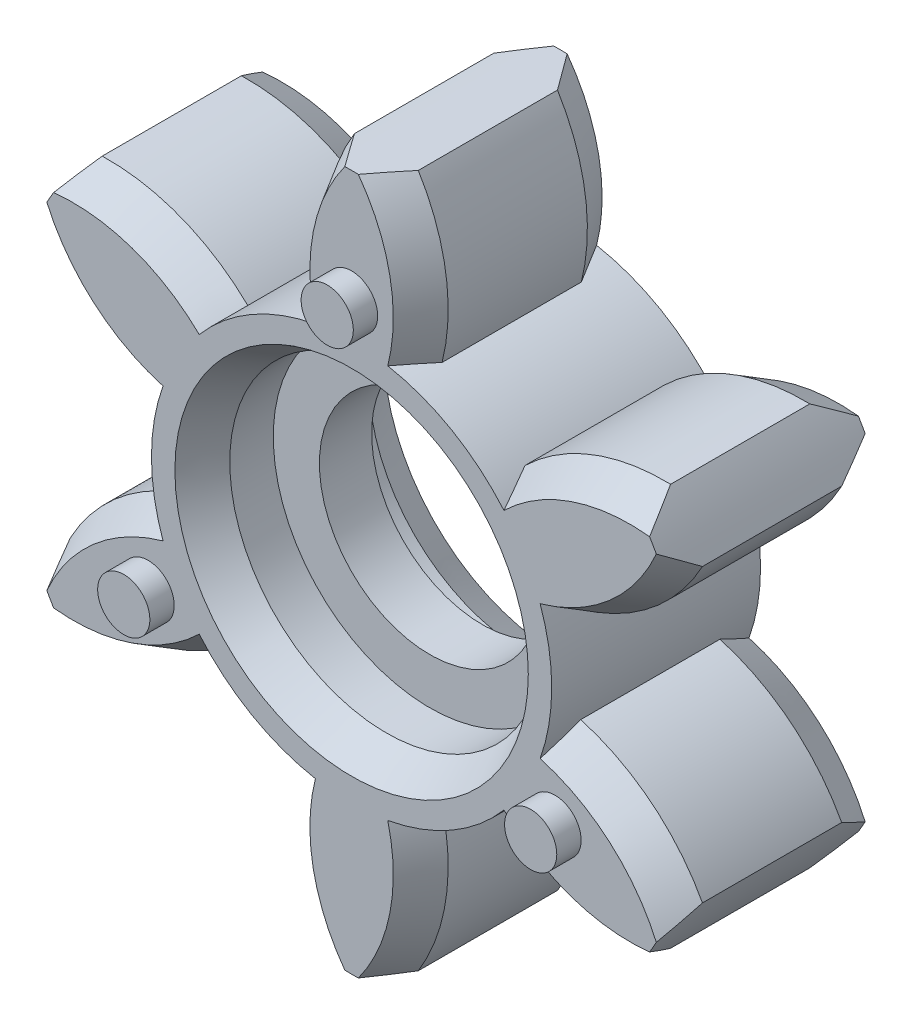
ISO-10303-21;
HEADER;
FILE_DESCRIPTION(('STEP AP214'),'2;1');
FILE_NAME('part.step','',(''),(''),'','','');
FILE_SCHEMA(('AUTOMOTIVE_DESIGN { 1 0 10303 214 1 1 1 1 }'));
ENDSEC;
DATA;
#1=APPLICATION_CONTEXT('core data for automotive mechanical design processes');
#2=APPLICATION_PROTOCOL_DEFINITION('international standard','automotive_design',2000,#1);
#3=PRODUCT_CONTEXT('',#1,'mechanical');
#4=PRODUCT('Part','Part','',(#3));
#5=PRODUCT_RELATED_PRODUCT_CATEGORY('part','',(#4));
#6=PRODUCT_DEFINITION_FORMATION('','',#4);
#7=PRODUCT_DEFINITION_CONTEXT('part definition',#1,'design');
#8=PRODUCT_DEFINITION('design','',#6,#7);
#9=PRODUCT_DEFINITION_SHAPE('','',#8);
#10=(LENGTH_UNIT() NAMED_UNIT(*) SI_UNIT(.MILLI.,.METRE.));
#11=(NAMED_UNIT(*) PLANE_ANGLE_UNIT() SI_UNIT($,.RADIAN.));
#12=(NAMED_UNIT(*) SI_UNIT($,.STERADIAN.) SOLID_ANGLE_UNIT());
#13=UNCERTAINTY_MEASURE_WITH_UNIT(LENGTH_MEASURE(1.E-05),#10,'distance_accuracy_value','');
#14=(GEOMETRIC_REPRESENTATION_CONTEXT(3) GLOBAL_UNCERTAINTY_ASSIGNED_CONTEXT((#13)) GLOBAL_UNIT_ASSIGNED_CONTEXT((#10,
#11,#12)) REPRESENTATION_CONTEXT('',''));
#15=CARTESIAN_POINT('',(0.,0.,0.));
#16=DIRECTION('',(0.,0.,1.));
#17=DIRECTION('',(1.,0.,0.));
#18=AXIS2_PLACEMENT_3D('',#15,#16,#17);
#19=CARTESIAN_POINT('',(0.,0.,-1.5));
#20=DIRECTION('',(0.,0.,1.));
#21=DIRECTION('',(1.,0.,0.));
#22=AXIS2_PLACEMENT_3D('',#19,#20,#21);
#23=PLANE('',#22);
#24=CARTESIAN_POINT('',(0.,0.,-1.5));
#25=DIRECTION('',(0.,0.,1.));
#26=DIRECTION('',(1.,0.,0.));
#27=AXIS2_PLACEMENT_3D('',#24,#25,#26);
#28=CIRCLE('',#27,6.35);
#29=CARTESIAN_POINT('',(6.35,0.,-1.5));
#30=VERTEX_POINT('',#29);
#31=EDGE_CURVE('E1338',#30,#30,#28,.T.);
#32=ORIENTED_EDGE('',*,*,#31,.T.);
#33=EDGE_LOOP('',(#32));
#34=FACE_BOUND('',#33,.T.);
#35=CARTESIAN_POINT('',(0.,0.,-1.5));
#36=DIRECTION('',(0.,0.,1.));
#37=DIRECTION('',(1.,0.,0.));
#38=AXIS2_PLACEMENT_3D('',#35,#36,#37);
#39=CIRCLE('',#38,9.);
#40=CARTESIAN_POINT('',(9.,0.,-1.5));
#41=VERTEX_POINT('',#40);
#42=EDGE_CURVE('E1341',#41,#41,#39,.F.);
#43=ORIENTED_EDGE('',*,*,#42,.T.);
#44=EDGE_LOOP('',(#43));
#45=FACE_BOUND('',#44,.T.);
#46=ADVANCED_FACE('F16',(#34,#45),#23,.F.);
#47=CARTESIAN_POINT('',(0.,0.,-7.4));
#48=DIRECTION('',(0.,0.,1.));
#49=DIRECTION('',(1.,0.,0.));
#50=AXIS2_PLACEMENT_3D('',#47,#48,#49);
#51=PLANE('',#50);
#52=CARTESIAN_POINT('',(11.69134295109,6.75,-7.4));
#53=DIRECTION('',(0.,0.,1.));
#54=DIRECTION('',(1.,0.,0.));
#55=AXIS2_PLACEMENT_3D('',#52,#53,#54);
#56=CIRCLE('',#55,1.5);
#57=CARTESIAN_POINT('',(13.19134295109,6.75,-7.4));
#58=VERTEX_POINT('',#57);
#59=EDGE_CURVE('E677',#58,#58,#56,.T.);
#60=ORIENTED_EDGE('',*,*,#59,.F.);
#61=EDGE_LOOP('',(#60));
#62=FACE_BOUND('',#61,.T.);
#63=ADVANCED_FACE('F1705',(#62),#51,.F.);
#64=CARTESIAN_POINT('',(0.,0.,-6.225));
#65=DIRECTION('',(0.,0.,1.));
#66=DIRECTION('',(1.,0.,0.));
#67=AXIS2_PLACEMENT_3D('',#64,#65,#66);
#68=CYLINDRICAL_SURFACE('',#67,9.);
#69=ORIENTED_EDGE('',*,*,#42,.F.);
#70=EDGE_LOOP('',(#69));
#71=FACE_BOUND('',#70,.T.);
#72=CARTESIAN_POINT('',(0.,0.,-3.99999999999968));
#73=DIRECTION('',(0.,0.,-1.));
#74=DIRECTION('',(-1.,0.,0.));
#75=AXIS2_PLACEMENT_3D('',#72,#73,#74);
#76=CIRCLE('',#75,9.00000000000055);
#77=CARTESIAN_POINT('',(-9.00000000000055,0.,-3.99999999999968));
#78=VERTEX_POINT('',#77);
#79=EDGE_CURVE('E674',#78,#78,#76,.T.);
#80=ORIENTED_EDGE('',*,*,#79,.T.);
#81=EDGE_LOOP('',(#80));
#82=FACE_BOUND('',#81,.T.);
#83=ADVANCED_FACE('F1695',(#71,#82),#68,.F.);
#84=CARTESIAN_POINT('',(0.,0.,-7.4));
#85=DIRECTION('',(0.,0.,1.));
#86=DIRECTION('',(1.,0.,0.));
#87=AXIS2_PLACEMENT_3D('',#84,#85,#86);
#88=PLANE('',#87);
#89=CARTESIAN_POINT('',(0.,-13.5,-7.4));
#90=DIRECTION('',(0.,0.,1.));
#91=DIRECTION('',(1.,0.,0.));
#92=AXIS2_PLACEMENT_3D('',#89,#90,#91);
#93=CIRCLE('',#92,1.5);
#94=CARTESIAN_POINT('',(1.5,-13.5,-7.4));
#95=VERTEX_POINT('',#94);
#96=EDGE_CURVE('E676',#95,#95,#93,.T.);
#97=ORIENTED_EDGE('',*,*,#96,.F.);
#98=EDGE_LOOP('',(#97));
#99=FACE_BOUND('',#98,.T.);
#100=ADVANCED_FACE('F1686',(#99),#88,.F.);
#101=CARTESIAN_POINT('',(0.,0.,-7.4));
#102=DIRECTION('',(0.,0.,1.));
#103=DIRECTION('',(1.,0.,0.));
#104=AXIS2_PLACEMENT_3D('',#101,#102,#103);
#105=PLANE('',#104);
#106=CARTESIAN_POINT('',(-11.69134295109,6.75,-7.4));
#107=DIRECTION('',(0.,0.,1.));
#108=DIRECTION('',(1.,0.,0.));
#109=AXIS2_PLACEMENT_3D('',#106,#107,#108);
#110=CIRCLE('',#109,1.5);
#111=CARTESIAN_POINT('',(-10.19134295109,6.75,-7.4));
#112=VERTEX_POINT('',#111);
#113=EDGE_CURVE('E1331',#112,#112,#110,.T.);
#114=ORIENTED_EDGE('',*,*,#113,.F.);
#115=EDGE_LOOP('',(#114));
#116=FACE_BOUND('',#115,.T.);
#117=ADVANCED_FACE('F1677',(#116),#105,.F.);
#118=CARTESIAN_POINT('',(0.,0.,35.4));
#119=DIRECTION('',(0.,0.,1.));
#120=DIRECTION('',(1.,0.,0.));
#121=AXIS2_PLACEMENT_3D('',#118,#119,#120);
#122=CYLINDRICAL_SURFACE('',#121,6.35);
#123=ORIENTED_EDGE('',*,*,#31,.F.);
#124=EDGE_LOOP('',(#123));
#125=FACE_BOUND('',#124,.T.);
#126=CARTESIAN_POINT('',(0.,0.,1.5));
#127=DIRECTION('',(0.,0.,1.));
#128=DIRECTION('',(1.,0.,0.));
#129=AXIS2_PLACEMENT_3D('',#126,#127,#128);
#130=CIRCLE('',#129,6.35);
#131=CARTESIAN_POINT('',(6.35,0.,1.5));
#132=VERTEX_POINT('',#131);
#133=EDGE_CURVE('E662',#132,#132,#130,.F.);
#134=ORIENTED_EDGE('',*,*,#133,.F.);
#135=EDGE_LOOP('',(#134));
#136=FACE_BOUND('',#135,.T.);
#137=ADVANCED_FACE('F426',(#125,#136),#122,.F.);
#138=CARTESIAN_POINT('',(11.69134295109,6.75,-7.4));
#139=DIRECTION('',(0.,0.,1.));
#140=DIRECTION('',(1.,0.,0.));
#141=AXIS2_PLACEMENT_3D('',#138,#139,#140);
#142=CYLINDRICAL_SURFACE('',#141,1.5);
#143=CARTESIAN_POINT('',(11.69134295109,6.75,-6.));
#144=DIRECTION('',(0.,0.,1.));
#145=DIRECTION('',(1.,0.,0.));
#146=AXIS2_PLACEMENT_3D('',#143,#144,#145);
#147=CIRCLE('',#146,1.5);
#148=CARTESIAN_POINT('',(13.19134295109,6.75,-6.));
#149=VERTEX_POINT('',#148);
#150=EDGE_CURVE('E345',#149,#149,#147,.T.);
#151=ORIENTED_EDGE('',*,*,#150,.F.);
#152=EDGE_LOOP('',(#151));
#153=FACE_BOUND('',#152,.T.);
#154=ORIENTED_EDGE('',*,*,#59,.T.);
#155=EDGE_LOOP('',(#154));
#156=FACE_BOUND('',#155,.T.);
#157=ADVANCED_FACE('F422',(#153,#156),#142,.T.);
#158=CARTESIAN_POINT('',(0.,0.,-6.00000000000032));
#159=DIRECTION('',(0.,0.,-1.));
#160=DIRECTION('',(-1.,0.,0.));
#161=AXIS2_PLACEMENT_3D('',#158,#159,#160);
#162=CONICAL_SURFACE('',#161,10.1547005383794,0.523598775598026);
#163=CARTESIAN_POINT('',(0.,0.,-6.00000000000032));
#164=DIRECTION('',(0.,0.,-1.));
#165=DIRECTION('',(-1.,0.,0.));
#166=AXIS2_PLACEMENT_3D('',#163,#164,#165);
#167=CIRCLE('',#166,10.1547005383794);
#168=CARTESIAN_POINT('',(-10.1547005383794,0.,-6.00000000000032));
#169=VERTEX_POINT('',#168);
#170=EDGE_CURVE('E1896',#169,#169,#167,.F.);
#171=ORIENTED_EDGE('',*,*,#170,.F.);
#172=EDGE_LOOP('',(#171));
#173=FACE_BOUND('',#172,.T.);
#174=ORIENTED_EDGE('',*,*,#79,.F.);
#175=EDGE_LOOP('',(#174));
#176=FACE_BOUND('',#175,.T.);
#177=ADVANCED_FACE('F418',(#173,#176),#162,.F.);
#178=CARTESIAN_POINT('',(0.,-13.5,-7.4));
#179=DIRECTION('',(0.,0.,1.));
#180=DIRECTION('',(1.,0.,0.));
#181=AXIS2_PLACEMENT_3D('',#178,#179,#180);
#182=CYLINDRICAL_SURFACE('',#181,1.5);
#183=CARTESIAN_POINT('',(0.,-13.5,-6.));
#184=DIRECTION('',(0.,0.,1.));
#185=DIRECTION('',(1.,0.,0.));
#186=AXIS2_PLACEMENT_3D('',#183,#184,#185);
#187=CIRCLE('',#186,1.5);
#188=CARTESIAN_POINT('',(1.5,-13.5,-6.));
#189=VERTEX_POINT('',#188);
#190=EDGE_CURVE('E1888',#189,#189,#187,.T.);
#191=ORIENTED_EDGE('',*,*,#190,.F.);
#192=EDGE_LOOP('',(#191));
#193=FACE_BOUND('',#192,.T.);
#194=ORIENTED_EDGE('',*,*,#96,.T.);
#195=EDGE_LOOP('',(#194));
#196=FACE_BOUND('',#195,.T.);
#197=ADVANCED_FACE('F414',(#193,#196),#182,.T.);
#198=CARTESIAN_POINT('',(-11.69134295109,6.75,-7.4));
#199=DIRECTION('',(0.,0.,1.));
#200=DIRECTION('',(1.,0.,0.));
#201=AXIS2_PLACEMENT_3D('',#198,#199,#200);
#202=CYLINDRICAL_SURFACE('',#201,1.5);
#203=CARTESIAN_POINT('',(-11.69134295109,6.75,-6.));
#204=DIRECTION('',(0.,0.,1.));
#205=DIRECTION('',(1.,0.,0.));
#206=AXIS2_PLACEMENT_3D('',#203,#204,#205);
#207=CIRCLE('',#206,1.5);
#208=CARTESIAN_POINT('',(-10.19134295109,6.75,-6.));
#209=VERTEX_POINT('',#208);
#210=EDGE_CURVE('E1885',#209,#209,#207,.T.);
#211=ORIENTED_EDGE('',*,*,#210,.F.);
#212=EDGE_LOOP('',(#211));
#213=FACE_BOUND('',#212,.T.);
#214=ORIENTED_EDGE('',*,*,#113,.T.);
#215=EDGE_LOOP('',(#214));
#216=FACE_BOUND('',#215,.T.);
#217=ADVANCED_FACE('F411',(#213,#216),#202,.T.);
#218=CARTESIAN_POINT('',(0.,0.,1.5));
#219=DIRECTION('',(0.,0.,1.));
#220=DIRECTION('',(1.,0.,0.));
#221=AXIS2_PLACEMENT_3D('',#218,#219,#220);
#222=PLANE('',#221);
#223=ORIENTED_EDGE('',*,*,#133,.T.);
#224=EDGE_LOOP('',(#223));
#225=FACE_BOUND('',#224,.T.);
#226=CARTESIAN_POINT('',(0.,0.,1.5));
#227=DIRECTION('',(0.,0.,1.));
#228=DIRECTION('',(1.,0.,0.));
#229=AXIS2_PLACEMENT_3D('',#226,#227,#228);
#230=CIRCLE('',#229,9.);
#231=CARTESIAN_POINT('',(9.,0.,1.5));
#232=VERTEX_POINT('',#231);
#233=EDGE_CURVE('E659',#232,#232,#230,.T.);
#234=ORIENTED_EDGE('',*,*,#233,.T.);
#235=EDGE_LOOP('',(#234));
#236=FACE_BOUND('',#235,.T.);
#237=ADVANCED_FACE('F409',(#225,#236),#222,.T.);
#238=CARTESIAN_POINT('',(8.,-13.85640646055,-3.99999999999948));
#239=DIRECTION('',(0.,0.,1.));
#240=DIRECTION('',(1.,0.,0.));
#241=AXIS2_PLACEMENT_3D('',#238,#239,#240);
#242=CONICAL_SURFACE('',#241,11.5500000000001,0.523598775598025);
#243=CARTESIAN_POINT('',(8.,-13.85640646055,-4.));
#244=DIRECTION('',(0.,0.,1.));
#245=DIRECTION('',(1.,0.,0.));
#246=AXIS2_PLACEMENT_3D('',#243,#244,#245);
#247=CIRCLE('',#246,11.55);
#248=CARTESIAN_POINT('',(18.1640667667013,-8.37058411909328,-4.0000000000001));
#249=VERTEX_POINT('',#248);
#250=CARTESIAN_POINT('',(11.1666087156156,-2.74897249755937,-3.99999999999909));
#251=VERTEX_POINT('',#250);
#252=EDGE_CURVE('E334',#249,#251,#247,.T.);
#253=ORIENTED_EDGE('',*,*,#252,.F.);
#254=CARTESIAN_POINT('',(17.5114296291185,-9.66177176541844,-5.99999982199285));
#255=CARTESIAN_POINT('',(17.5698139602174,-9.55595201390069,-5.83351244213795));
#256=CARTESIAN_POINT('',(17.6271969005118,-9.44968188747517,-5.666961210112));
#257=CARTESIAN_POINT('',(17.7399577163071,-9.23625866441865,-5.33377440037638));
#258=CARTESIAN_POINT('',(17.7953358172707,-9.1291056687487,-5.16713883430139));
#259=CARTESIAN_POINT('',(17.9584833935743,-8.80630409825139,-4.66710038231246));
#260=CARTESIAN_POINT('',(18.063261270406,-8.58932177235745,-4.33357964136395));
#261=CARTESIAN_POINT('',(18.1640667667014,-8.37058411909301,-4.00000000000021));
#262=B_SPLINE_CURVE_WITH_KNOTS('',3,(#254,#255,#256,#257,#258,#259,#260,#261),.UNSPECIFIED.,.F.,
.F.,(4,2,2,4),(0.,0.617183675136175,1.23429772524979,2.46857733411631),.UNSPECIFIED.);
#263=CARTESIAN_POINT('',(17.511429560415,-9.66177182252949,-5.99999990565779));
#264=VERTEX_POINT('',#263);
#265=EDGE_CURVE('E332',#264,#249,#262,.T.);
#266=ORIENTED_EDGE('',*,*,#265,.F.);
#267=CARTESIAN_POINT('',(8.,-13.85640646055,-6.));
#268=DIRECTION('',(0.,0.,-1.));
#269=DIRECTION('',(-1.,0.,0.));
#270=AXIS2_PLACEMENT_3D('',#267,#268,#269);
#271=CIRCLE('',#270,10.3952994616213);
#272=CARTESIAN_POINT('',(10.8348079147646,-3.85503206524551,-5.99998699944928));
#273=VERTEX_POINT('',#272);
#274=EDGE_CURVE('E317',#273,#264,#271,.T.);
#275=ORIENTED_EDGE('',*,*,#274,.F.);
#276=CARTESIAN_POINT('',(11.1666087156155,-2.74897249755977,-3.99999999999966));
#277=CARTESIAN_POINT('',(11.1205669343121,-2.93599503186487,-4.33338540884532));
#278=CARTESIAN_POINT('',(11.0698796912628,-3.12167684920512,-4.66674112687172));
#279=CARTESIAN_POINT('',(10.9592142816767,-3.49035904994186,-5.33339318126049));
#280=CARTESIAN_POINT('',(10.8992361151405,-3.67335943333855,-5.66668951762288));
#281=CARTESIAN_POINT('',(10.8346124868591,-3.85501909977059,-5.99995616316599));
#282=B_SPLINE_CURVE_WITH_KNOTS('',3,(#276,#277,#278,#279,#280,#281),.UNSPECIFIED.,.F.,.F.,(4,2,
4),(0.,1.15479726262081,2.30959452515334),.UNSPECIFIED.);
#283=EDGE_CURVE('E647',#251,#273,#282,.T.);
#284=ORIENTED_EDGE('',*,*,#283,.F.);
#285=EDGE_LOOP('',(#253,#266,#275,#284));
#286=FACE_BOUND('',#285,.T.);
#287=ADVANCED_FACE('F333',(#286),#242,.T.);
#288=CARTESIAN_POINT('',(8.,13.85640646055,-3.99999999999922));
#289=DIRECTION('',(0.,0.,1.));
#290=DIRECTION('',(1.,0.,0.));
#291=AXIS2_PLACEMENT_3D('',#288,#289,#290);
#292=CONICAL_SURFACE('',#291,11.5499999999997,0.523598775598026);
#293=CARTESIAN_POINT('',(8.,13.85640646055,-4.));
#294=DIRECTION('',(0.,0.,1.));
#295=DIRECTION('',(1.,0.,0.));
#296=AXIS2_PLACEMENT_3D('',#293,#294,#295);
#297=CIRCLE('',#296,11.55);
#298=CARTESIAN_POINT('',(11.1666087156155,2.74897249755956,-3.9999999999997));
#299=VERTEX_POINT('',#298);
#300=CARTESIAN_POINT('',(18.1640667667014,8.37058411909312,-4.00000000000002));
#301=VERTEX_POINT('',#300);
#302=EDGE_CURVE('E660',#299,#301,#297,.T.);
#303=ORIENTED_EDGE('',*,*,#302,.F.);
#304=CARTESIAN_POINT('',(10.8346052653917,3.85504492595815,-5.99999890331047));
#305=CARTESIAN_POINT('',(10.8992300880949,3.67338039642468,-5.66672544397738));
#306=CARTESIAN_POINT('',(10.9592094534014,3.49037543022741,-5.33342214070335));
#307=CARTESIAN_POINT('',(11.0698772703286,3.12168462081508,-4.66675583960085));
#308=CARTESIAN_POINT('',(11.1205657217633,2.93599877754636,-4.33339284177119));
#309=CARTESIAN_POINT('',(11.1666087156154,2.74897249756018,-3.99999999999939));
#310=B_SPLINE_CURVE_WITH_KNOTS('',3,(#304,#305,#306,#307,#308,#309),.UNSPECIFIED.,.F.,.F.,(4,2,
4),(0.,1.15482245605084,2.30964493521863),.UNSPECIFIED.);
#311=CARTESIAN_POINT('',(10.8346040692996,3.85504275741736,-6.00000000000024));
#312=VERTEX_POINT('',#311);
#313=EDGE_CURVE('E656',#312,#299,#310,.T.);
#314=ORIENTED_EDGE('',*,*,#313,.F.);
#315=CARTESIAN_POINT('',(8.,13.85640646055,-6.00000000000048));
#316=DIRECTION('',(0.,0.,1.));
#317=DIRECTION('',(1.,0.,0.));
#318=AXIS2_PLACEMENT_3D('',#315,#316,#317);
#319=CIRCLE('',#318,10.3952994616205);
#320=CARTESIAN_POINT('',(17.5114295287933,9.66177187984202,-5.9999999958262));
#321=VERTEX_POINT('',#320);
#322=EDGE_CURVE('E328',#321,#312,#319,.F.);
#323=ORIENTED_EDGE('',*,*,#322,.F.);
#324=CARTESIAN_POINT('',(18.1640667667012,8.37058411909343,-3.99999999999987));
#325=CARTESIAN_POINT('',(18.0632612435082,8.58932179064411,-4.33357966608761));
#326=CARTESIAN_POINT('',(17.9584833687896,8.80630413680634,-4.66710044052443));
#327=CARTESIAN_POINT('',(17.7953357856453,9.12910573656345,-5.1671389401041));
#328=CARTESIAN_POINT('',(17.7399576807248,9.23625874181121,-5.33377452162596));
#329=CARTESIAN_POINT('',(17.627196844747,9.44968198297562,-5.66696135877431));
#330=CARTESIAN_POINT('',(17.5698138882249,9.55595211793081,-5.83351260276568));
#331=CARTESIAN_POINT('',(17.5114295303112,9.66177187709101,-5.99999999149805));
#332=B_SPLINE_CURVE_WITH_KNOTS('',3,(#324,#325,#326,#327,#328,#329,#330,#331),.UNSPECIFIED.,.F.,
.F.,(4,2,2,4),(0.,1.23427971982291,1.85139382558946,2.46857755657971),.UNSPECIFIED.);
#333=EDGE_CURVE('E1260',#301,#321,#332,.T.);
#334=ORIENTED_EDGE('',*,*,#333,.F.);
#335=EDGE_LOOP('',(#303,#314,#323,#334));
#336=FACE_BOUND('',#335,.T.);
#337=ADVANCED_FACE('F1292',(#336),#292,.T.);
#338=CARTESIAN_POINT('',(8.,13.85640646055,-6.));
#339=DIRECTION('',(0.,0.,1.));
#340=DIRECTION('',(1.,0.,0.));
#341=AXIS2_PLACEMENT_3D('',#338,#339,#340);
#342=CYLINDRICAL_SURFACE('',#341,11.55);
#343=DIRECTION('',(0.,0.,1.));
#344=VECTOR('',#343,1.);
#345=CARTESIAN_POINT('',(18.1640667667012,8.37058411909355,-6.));
#346=LINE('',#345,#344);
#347=CARTESIAN_POINT('',(18.1640667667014,8.37058411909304,4.00000000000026));
#348=VERTEX_POINT('',#347);
#349=EDGE_CURVE('E1257',#348,#301,#346,.F.);
#350=ORIENTED_EDGE('',*,*,#349,.F.);
#351=CARTESIAN_POINT('',(8.,13.85640646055,3.99999999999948));
#352=DIRECTION('',(0.,0.,-1.));
#353=DIRECTION('',(-1.,0.,0.));
#354=AXIS2_PLACEMENT_3D('',#351,#352,#353);
#355=CIRCLE('',#354,11.5500000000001);
#356=CARTESIAN_POINT('',(11.1666087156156,2.74897249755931,3.99999999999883));
#357=VERTEX_POINT('',#356);
#358=EDGE_CURVE('E657',#357,#348,#355,.F.);
#359=ORIENTED_EDGE('',*,*,#358,.F.);
#360=DIRECTION('',(0.,0.,-1.));
#361=VECTOR('',#360,1.);
#362=CARTESIAN_POINT('',(11.1666087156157,2.74897249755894,6.6));
#363=LINE('',#362,#361);
#364=EDGE_CURVE('E653',#299,#357,#363,.F.);
#365=ORIENTED_EDGE('',*,*,#364,.F.);
#366=ORIENTED_EDGE('',*,*,#302,.T.);
#367=EDGE_LOOP('',(#350,#359,#365,#366));
#368=FACE_BOUND('',#367,.T.);
#369=ADVANCED_FACE('F1295',(#368),#342,.T.);
#370=CARTESIAN_POINT('',(8.,-13.85640646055,-6.));
#371=DIRECTION('',(0.,0.,1.));
#372=DIRECTION('',(1.,0.,0.));
#373=AXIS2_PLACEMENT_3D('',#370,#371,#372);
#374=CYLINDRICAL_SURFACE('',#373,11.55);
#375=DIRECTION('',(0.,0.,1.));
#376=VECTOR('',#375,1.);
#377=CARTESIAN_POINT('',(18.1640667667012,-8.37058411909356,-6.));
#378=LINE('',#377,#376);
#379=CARTESIAN_POINT('',(18.1640667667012,-8.37058411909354,4.00000000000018));
#380=VERTEX_POINT('',#379);
#381=EDGE_CURVE('E337',#249,#380,#378,.T.);
#382=ORIENTED_EDGE('',*,*,#381,.F.);
#383=ORIENTED_EDGE('',*,*,#252,.T.);
#384=DIRECTION('',(0.,0.,-1.));
#385=VECTOR('',#384,1.);
#386=CARTESIAN_POINT('',(11.1666087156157,-2.74897249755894,6.6));
#387=LINE('',#386,#385);
#388=CARTESIAN_POINT('',(11.1666087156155,-2.74897249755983,3.99999999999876));
#389=VERTEX_POINT('',#388);
#390=EDGE_CURVE('E644',#389,#251,#387,.T.);
#391=ORIENTED_EDGE('',*,*,#390,.F.);
#392=CARTESIAN_POINT('',(8.,-13.85640646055,4.00000000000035));
#393=DIRECTION('',(0.,0.,-1.));
#394=DIRECTION('',(-1.,0.,0.));
#395=AXIS2_PLACEMENT_3D('',#392,#393,#394);
#396=CIRCLE('',#395,11.5499999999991);
#397=EDGE_CURVE('E649',#380,#389,#396,.F.);
#398=ORIENTED_EDGE('',*,*,#397,.F.);
#399=EDGE_LOOP('',(#382,#383,#391,#398));
#400=FACE_BOUND('',#399,.T.);
#401=ADVANCED_FACE('F1044',(#400),#374,.T.);
#402=CARTESIAN_POINT('',(0.,0.,-6.));
#403=DIRECTION('',(0.,0.,1.));
#404=DIRECTION('',(1.,0.,0.));
#405=AXIS2_PLACEMENT_3D('',#402,#403,#404);
#406=CYLINDRICAL_SURFACE('',#405,20.);
#407=DIRECTION('',(0.,0.,1.));
#408=VECTOR('',#407,1.);
#409=CARTESIAN_POINT('',(16.3311718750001,-11.5452511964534,-6.));
#410=LINE('',#409,#408);
#411=CARTESIAN_POINT('',(16.3311718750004,-11.5452511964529,-4.00000000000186));
#412=VERTEX_POINT('',#411);
#413=CARTESIAN_POINT('',(16.3311718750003,-11.5452511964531,3.99999999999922));
#414=VERTEX_POINT('',#413);
#415=EDGE_CURVE('E641',#412,#414,#410,.T.);
#416=ORIENTED_EDGE('',*,*,#415,.F.);
#417=CARTESIAN_POINT('',(17.1230546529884,-10.3344569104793,-5.99999997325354));
#418=CARTESIAN_POINT('',(17.0606042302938,-10.4379291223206,-5.83351258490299));
#419=CARTESIAN_POINT('',(16.9972630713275,-10.5407592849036,-5.66696134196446));
#420=CARTESIAN_POINT('',(16.8688135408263,-10.7451246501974,-5.33377450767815));
#421=CARTESIAN_POINT('',(16.8037053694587,-10.8466599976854,-5.1671389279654));
#422=CARTESIAN_POINT('',(16.6057247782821,-11.1493507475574,-4.66710043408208));
#423=CARTESIAN_POINT('',(16.4702014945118,-11.3485822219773,-4.33357966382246));
#424=CARTESIAN_POINT('',(16.3311718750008,-11.5452511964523,-4.00000000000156));
#425=B_SPLINE_CURVE_WITH_KNOTS('',3,(#417,#418,#419,#420,#421,#422,#423,#424),.UNSPECIFIED.,.F.,
.F.,(4,2,2,4),(0.,0.617183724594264,1.23429782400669,2.46857753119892),.UNSPECIFIED.);
#426=CARTESIAN_POINT('',(17.1230546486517,-10.3344569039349,-6.));
#427=VERTEX_POINT('',#426);
#428=EDGE_CURVE('E341',#427,#412,#425,.T.);
#429=ORIENTED_EDGE('',*,*,#428,.F.);
#430=CARTESIAN_POINT('',(0.,0.,-6.));
#431=DIRECTION('',(0.,0.,1.));
#432=DIRECTION('',(1.,0.,0.));
#433=AXIS2_PLACEMENT_3D('',#430,#431,#432);
#434=CIRCLE('',#433,20.);
#435=EDGE_CURVE('E321',#264,#427,#434,.F.);
#436=ORIENTED_EDGE('',*,*,#435,.F.);
#437=ORIENTED_EDGE('',*,*,#265,.T.);
#438=ORIENTED_EDGE('',*,*,#381,.T.);
#439=CARTESIAN_POINT('',(17.5114295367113,-9.66177187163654,5.99999998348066));
#440=CARTESIAN_POINT('',(17.5698138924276,-9.55595211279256,5.83351259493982));
#441=CARTESIAN_POINT('',(17.6271968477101,-9.44968197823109,5.66696135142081));
#442=CARTESIAN_POINT('',(17.7399576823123,-9.23625873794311,5.33377451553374));
#443=CARTESIAN_POINT('',(17.7953357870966,-9.12910573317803,5.16713893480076));
#444=CARTESIAN_POINT('',(17.9584833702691,-8.80630413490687,4.66710043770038));
#445=CARTESIAN_POINT('',(18.063261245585,-8.58932178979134,4.33357966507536));
#446=CARTESIAN_POINT('',(18.1640667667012,-8.37058411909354,4.00000000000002));
#447=B_SPLINE_CURVE_WITH_KNOTS('',3,(#439,#440,#441,#442,#443,#444,#445,#446),.UNSPECIFIED.,.F.,
.F.,(4,2,2,4),(0.,0.617183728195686,1.23429783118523,2.46857754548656),.UNSPECIFIED.);
#448=CARTESIAN_POINT('',(17.5114295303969,-9.66177187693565,5.99999999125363));
#449=VERTEX_POINT('',#448);
#450=EDGE_CURVE('E651',#449,#380,#447,.T.);
#451=ORIENTED_EDGE('',*,*,#450,.F.);
#452=CARTESIAN_POINT('',(0.,0.,6.));
#453=DIRECTION('',(0.,0.,1.));
#454=DIRECTION('',(1.,0.,0.));
#455=AXIS2_PLACEMENT_3D('',#452,#453,#454);
#456=CIRCLE('',#455,20.);
#457=CARTESIAN_POINT('',(17.1230546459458,-10.3344569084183,5.99999999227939));
#458=VERTEX_POINT('',#457);
#459=EDGE_CURVE('E643',#449,#458,#456,.F.);
#460=ORIENTED_EDGE('',*,*,#459,.T.);
#461=CARTESIAN_POINT('',(16.3311718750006,-11.5452511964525,4.00000000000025));
#462=CARTESIAN_POINT('',(16.4702014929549,-11.348582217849,4.33357966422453));
#463=CARTESIAN_POINT('',(16.6057247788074,-11.1493507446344,4.66710043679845));
#464=CARTESIAN_POINT('',(16.8037053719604,-10.8466599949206,5.16713893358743));
#465=CARTESIAN_POINT('',(16.8688135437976,-10.7451246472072,5.33377451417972));
#466=CARTESIAN_POINT('',(16.997263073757,-10.5407592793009,5.66696134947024));
#467=CARTESIAN_POINT('',(17.0606042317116,-10.4379291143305,5.83351259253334));
#468=CARTESIAN_POINT('',(17.1230546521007,-10.3344568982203,5.99999998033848));
#469=B_SPLINE_CURVE_WITH_KNOTS('',3,(#461,#462,#463,#464,#465,#466,#467,#468),.UNSPECIFIED.,.F.,
.F.,(4,2,2,4),(0.,1.23427971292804,1.85139381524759,2.46857754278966),.UNSPECIFIED.);
#470=EDGE_CURVE('E631',#414,#458,#469,.T.);
#471=ORIENTED_EDGE('',*,*,#470,.F.);
#472=EDGE_LOOP('',(#416,#429,#436,#437,#438,#451,#460,#471));
#473=FACE_BOUND('',#472,.T.);
#474=ADVANCED_FACE('F340',(#473),#406,.T.);
#475=CARTESIAN_POINT('',(16.,0.,-6.));
#476=DIRECTION('',(0.,0.,1.));
#477=DIRECTION('',(1.,0.,0.));
#478=AXIS2_PLACEMENT_3D('',#475,#476,#477);
#479=CYLINDRICAL_SURFACE('',#478,11.55);
#480=ORIENTED_EDGE('',*,*,#415,.T.);
#481=CARTESIAN_POINT('',(16.,0.,3.99999999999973));
#482=DIRECTION('',(0.,0.,-1.));
#483=DIRECTION('',(-1.,0.,0.));
#484=AXIS2_PLACEMENT_3D('',#481,#482,#483);
#485=CIRCLE('',#484,11.5499999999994);
#486=CARTESIAN_POINT('',(7.96398437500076,-8.29608057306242,4.00000000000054));
#487=VERTEX_POINT('',#486);
#488=EDGE_CURVE('E637',#487,#414,#485,.F.);
#489=ORIENTED_EDGE('',*,*,#488,.F.);
#490=DIRECTION('',(0.,0.,-1.));
#491=VECTOR('',#490,1.);
#492=CARTESIAN_POINT('',(7.9639843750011,-8.2960805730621,6.6));
#493=LINE('',#492,#491);
#494=CARTESIAN_POINT('',(7.96398437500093,-8.29608057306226,-4.00000000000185));
#495=VERTEX_POINT('',#494);
#496=EDGE_CURVE('E629',#495,#487,#493,.F.);
#497=ORIENTED_EDGE('',*,*,#496,.F.);
#498=CARTESIAN_POINT('',(16.,0.,-4.00000000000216));
#499=DIRECTION('',(0.,0.,1.));
#500=DIRECTION('',(1.,0.,0.));
#501=AXIS2_PLACEMENT_3D('',#498,#499,#500);
#502=CIRCLE('',#501,11.5499999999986);
#503=EDGE_CURVE('E632',#412,#495,#502,.F.);
#504=ORIENTED_EDGE('',*,*,#503,.F.);
#505=EDGE_LOOP('',(#480,#489,#497,#504));
#506=FACE_BOUND('',#505,.T.);
#507=ADVANCED_FACE('F1043',(#506),#479,.T.);
#508=CARTESIAN_POINT('',(-8.,-13.85640646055,-3.99999999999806));
#509=DIRECTION('',(0.,0.,1.));
#510=DIRECTION('',(1.,0.,0.));
#511=AXIS2_PLACEMENT_3D('',#508,#509,#510);
#512=CONICAL_SURFACE('',#511,11.5499999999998,0.523598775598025);
#513=CARTESIAN_POINT('',(-8.,-13.85640646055,-4.));
#514=DIRECTION('',(0.,0.,1.));
#515=DIRECTION('',(1.,0.,0.));
#516=AXIS2_PLACEMENT_3D('',#513,#514,#515);
#517=CIRCLE('',#516,11.55);
#518=CARTESIAN_POINT('',(1.8328948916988,-19.9158353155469,-4.00000000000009));
#519=VERTEX_POINT('',#518);
#520=CARTESIAN_POINT('',(3.20262434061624,-11.0450530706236,-3.99999999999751));
#521=VERTEX_POINT('',#520);
#522=EDGE_CURVE('E442',#519,#521,#517,.T.);
#523=ORIENTED_EDGE('',*,*,#522,.F.);
#524=CARTESIAN_POINT('',(0.387744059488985,-19.9962410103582,-6.00086911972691));
#525=CARTESIAN_POINT('',(0.508631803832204,-19.9938962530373,-5.83430951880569));
#526=CARTESIAN_POINT('',(0.629408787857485,-19.9904581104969,-5.66768598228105));
#527=CARTESIAN_POINT('',(0.87072468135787,-19.9814019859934,-5.33435445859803));
#528=CARTESIAN_POINT('',(0.991263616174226,-19.9757842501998,-5.16764648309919));
#529=CARTESIAN_POINT('',(1.35254948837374,-19.9556703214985,-4.66739064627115));
#530=CARTESIAN_POINT('',(1.59295539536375,-19.9379136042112,-4.33372479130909));
#531=CARTESIAN_POINT('',(1.8328948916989,-19.9158353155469,-4.00000000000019));
#532=B_SPLINE_CURVE_WITH_KNOTS('',3,(#524,#525,#526,#527,#528,#529,#530,#531),.UNSPECIFIED.,.F.,
.F.,(4,2,2,4),(0.,0.617452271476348,1.23483482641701,2.4696515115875),.UNSPECIFIED.);
#533=CARTESIAN_POINT('',(0.388374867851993,-19.9962287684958,-6.));
#534=VERTEX_POINT('',#533);
#535=EDGE_CURVE('E432',#534,#519,#532,.T.);
#536=ORIENTED_EDGE('',*,*,#535,.F.);
#537=CARTESIAN_POINT('',(-8.,-13.85640646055,-6.));
#538=DIRECTION('',(0.,0.,-1.));
#539=DIRECTION('',(-1.,0.,0.));
#540=AXIS2_PLACEMENT_3D('',#537,#538,#539);
#541=CIRCLE('',#540,10.3952994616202);
#542=CARTESIAN_POINT('',(2.0787368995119,-11.3105637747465,-5.99999986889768));
#543=VERTEX_POINT('',#542);
#544=EDGE_CURVE('E388',#543,#534,#541,.T.);
#545=ORIENTED_EDGE('',*,*,#544,.F.);
#546=CARTESIAN_POINT('',(3.20262434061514,-11.0450530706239,-3.99999999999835));
#547=CARTESIAN_POINT('',(3.01763314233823,-11.0986921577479,-4.33339269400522));
#548=CARTESIAN_POINT('',(2.83148025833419,-11.1476375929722,-4.66675569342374));
#549=CARTESIAN_POINT('',(2.45685111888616,-11.2361411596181,-5.33342230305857));
#550=CARTESIAN_POINT('',(2.26837486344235,-11.2756992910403,-5.66672591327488));
#551=CARTESIAN_POINT('',(2.07873692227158,-11.3105637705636,-5.99999982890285));
#552=B_SPLINE_CURVE_WITH_KNOTS('',3,(#546,#547,#548,#549,#550,#551),.UNSPECIFIED.,.F.,.F.,(4,2,
4),(0.,1.15482248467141,2.30964496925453),.UNSPECIFIED.);
#553=EDGE_CURVE('E622',#521,#543,#552,.T.);
#554=ORIENTED_EDGE('',*,*,#553,.F.);
#555=EDGE_LOOP('',(#523,#536,#545,#554));
#556=FACE_BOUND('',#555,.T.);
#557=ADVANCED_FACE('F1096',(#556),#512,.T.);
#558=CARTESIAN_POINT('',(16.,0.,-4.00000000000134));
#559=DIRECTION('',(0.,0.,1.));
#560=DIRECTION('',(1.,0.,0.));
#561=AXIS2_PLACEMENT_3D('',#558,#559,#560);
#562=CONICAL_SURFACE('',#561,11.5499999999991,0.523598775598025);
#563=ORIENTED_EDGE('',*,*,#503,.T.);
#564=CARTESIAN_POINT('',(8.75585470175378,-7.45553542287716,-5.99996678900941));
#565=CARTESIAN_POINT('',(8.6308440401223,-7.60233181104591,-5.66669837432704));
#566=CARTESIAN_POINT('',(8.50234951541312,-7.74577543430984,-5.33340026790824));
#567=CARTESIAN_POINT('',(8.23839273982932,-8.02595715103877,-4.66674467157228));
#568=CARTESIAN_POINT('',(8.10293048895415,-8.16269524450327,-4.33338718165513));
#569=CARTESIAN_POINT('',(7.96398437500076,-8.29608057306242,-4.00000000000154));
#570=B_SPLINE_CURVE_WITH_KNOTS('',3,(#564,#565,#566,#567,#568,#569),.UNSPECIFIED.,.F.,.F.,(4,2,
4),(0.,1.15480340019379,2.30960680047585),.UNSPECIFIED.);
#571=CARTESIAN_POINT('',(8.75583746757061,-7.45555856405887,-5.99998344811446));
#572=VERTEX_POINT('',#571);
#573=EDGE_CURVE('E1112',#572,#495,#570,.T.);
#574=ORIENTED_EDGE('',*,*,#573,.F.);
#575=CARTESIAN_POINT('',(16.,0.,-6.));
#576=DIRECTION('',(0.,0.,-1.));
#577=DIRECTION('',(-1.,0.,0.));
#578=AXIS2_PLACEMENT_3D('',#575,#576,#577);
#579=CIRCLE('',#578,10.3952994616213);
#580=EDGE_CURVE('E343',#427,#572,#579,.T.);
#581=ORIENTED_EDGE('',*,*,#580,.F.);
#582=ORIENTED_EDGE('',*,*,#428,.T.);
#583=EDGE_LOOP('',(#563,#574,#581,#582));
#584=FACE_BOUND('',#583,.T.);
#585=ADVANCED_FACE('F1099',(#584),#562,.T.);
#586=CARTESIAN_POINT('',(-8.,-13.85640646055,-6.));
#587=DIRECTION('',(0.,0.,1.));
#588=DIRECTION('',(1.,0.,0.));
#589=AXIS2_PLACEMENT_3D('',#586,#587,#588);
#590=CYLINDRICAL_SURFACE('',#589,11.55);
#591=CARTESIAN_POINT('',(-8.,-13.85640646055,3.99999999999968));
#592=DIRECTION('',(0.,0.,-1.));
#593=DIRECTION('',(-1.,0.,0.));
#594=AXIS2_PLACEMENT_3D('',#591,#592,#593);
#595=CIRCLE('',#594,11.5499999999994);
#596=CARTESIAN_POINT('',(1.8328948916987,-19.9158353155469,4.00000000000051));
#597=VERTEX_POINT('',#596);
#598=CARTESIAN_POINT('',(3.20262434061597,-11.0450530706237,3.99999999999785));
#599=VERTEX_POINT('',#598);
#600=EDGE_CURVE('E624',#597,#599,#595,.F.);
#601=ORIENTED_EDGE('',*,*,#600,.F.);
#602=DIRECTION('',(0.,0.,1.));
#603=VECTOR('',#602,1.);
#604=CARTESIAN_POINT('',(1.8328948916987,-19.9158353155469,-6.));
#605=LINE('',#604,#603);
#606=EDGE_CURVE('E441',#519,#597,#605,.T.);
#607=ORIENTED_EDGE('',*,*,#606,.F.);
#608=ORIENTED_EDGE('',*,*,#522,.T.);
#609=DIRECTION('',(0.,0.,-1.));
#610=VECTOR('',#609,1.);
#611=CARTESIAN_POINT('',(3.20262434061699,-11.0450530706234,6.6));
#612=LINE('',#611,#610);
#613=EDGE_CURVE('E619',#599,#521,#612,.T.);
#614=ORIENTED_EDGE('',*,*,#613,.F.);
#615=EDGE_LOOP('',(#601,#607,#608,#614));
#616=FACE_BOUND('',#615,.T.);
#617=ADVANCED_FACE('F458',(#616),#590,.T.);
#618=CARTESIAN_POINT('',(0.,0.,-6.));
#619=DIRECTION('',(0.,0.,1.));
#620=DIRECTION('',(1.,0.,0.));
#621=AXIS2_PLACEMENT_3D('',#618,#619,#620);
#622=CYLINDRICAL_SURFACE('',#621,20.);
#623=DIRECTION('',(0.,0.,1.));
#624=VECTOR('',#623,1.);
#625=CARTESIAN_POINT('',(-1.83289489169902,-19.9158353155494,-6.));
#626=LINE('',#625,#624);
#627=CARTESIAN_POINT('',(-1.83289489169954,-19.9158353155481,-3.99999999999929));
#628=VERTEX_POINT('',#627);
#629=CARTESIAN_POINT('',(-1.83289489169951,-19.9158353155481,3.9999999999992));
#630=VERTEX_POINT('',#629);
#631=EDGE_CURVE('E614',#628,#630,#626,.T.);
#632=ORIENTED_EDGE('',*,*,#631,.F.);
#633=CARTESIAN_POINT('',(-0.38767078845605,-19.9962424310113,-6.00097007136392));
#634=CARTESIAN_POINT('',(-0.508564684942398,-19.9938979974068,-5.83440208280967));
#635=CARTESIAN_POINT('',(-0.629347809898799,-19.9904600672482,-5.66777014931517));
#636=CARTESIAN_POINT('',(-0.870675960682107,-19.9814041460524,-5.33442181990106));
#637=CARTESIAN_POINT('',(-0.991221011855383,-19.9757864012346,-5.16770543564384));
#638=CARTESIAN_POINT('',(-1.35252520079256,-19.9556721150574,-4.66742435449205));
#639=CARTESIAN_POINT('',(-1.592943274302,-19.937914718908,-4.33374164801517));
#640=CARTESIAN_POINT('',(-1.83289489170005,-19.9158353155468,-3.99999999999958));
#641=B_SPLINE_CURVE_WITH_KNOTS('',3,(#633,#634,#635,#636,#637,#638,#639,#640),.UNSPECIFIED.,.F.,
.F.,(4,2,2,4),(0.,0.617483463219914,1.23489719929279,2.46977625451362),.UNSPECIFIED.);
#642=CARTESIAN_POINT('',(-0.388374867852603,-19.9962287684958,-6.00000000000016));
#643=VERTEX_POINT('',#642);
#644=EDGE_CURVE('E482',#643,#628,#641,.T.);
#645=ORIENTED_EDGE('',*,*,#644,.F.);
#646=CARTESIAN_POINT('',(0.,0.,-6.));
#647=DIRECTION('',(0.,0.,1.));
#648=DIRECTION('',(1.,0.,0.));
#649=AXIS2_PLACEMENT_3D('',#646,#647,#648);
#650=CIRCLE('',#649,20.);
#651=EDGE_CURVE('E385',#534,#643,#650,.F.);
#652=ORIENTED_EDGE('',*,*,#651,.F.);
#653=ORIENTED_EDGE('',*,*,#535,.T.);
#654=ORIENTED_EDGE('',*,*,#606,.T.);
#655=CARTESIAN_POINT('',(0.387670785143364,-19.9962424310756,6.00097007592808));
#656=CARTESIAN_POINT('',(0.508564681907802,-19.9938979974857,5.83440208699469));
#657=CARTESIAN_POINT('',(0.629347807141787,-19.9904600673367,5.66777015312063));
#658=CARTESIAN_POINT('',(0.870675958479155,-19.98140414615,5.33442182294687));
#659=CARTESIAN_POINT('',(0.991221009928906,-19.9757864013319,5.16770543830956));
#660=CARTESIAN_POINT('',(1.35252519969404,-19.9556721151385,4.66742435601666));
#661=CARTESIAN_POINT('',(1.59294327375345,-19.9379147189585,4.33374164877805));
#662=CARTESIAN_POINT('',(1.8328948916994,-19.9158353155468,4.0000000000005));
#663=B_SPLINE_CURVE_WITH_KNOTS('',3,(#655,#656,#657,#658,#659,#660,#661,#662),.UNSPECIFIED.,.F.,
.F.,(4,2,2,4),(0.,0.617483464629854,1.23489720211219,2.46977626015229),.UNSPECIFIED.);
#664=CARTESIAN_POINT('',(0.388374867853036,-19.9962287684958,5.99999999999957));
#665=VERTEX_POINT('',#664);
#666=EDGE_CURVE('E465',#665,#597,#663,.T.);
#667=ORIENTED_EDGE('',*,*,#666,.F.);
#668=CARTESIAN_POINT('',(0.,0.,5.999999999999));
#669=DIRECTION('',(0.,0.,1.));
#670=DIRECTION('',(1.,0.,0.));
#671=AXIS2_PLACEMENT_3D('',#668,#669,#670);
#672=CIRCLE('',#671,20.);
#673=CARTESIAN_POINT('',(-0.38837486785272,-19.9962287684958,6.));
#674=VERTEX_POINT('',#673);
#675=EDGE_CURVE('E443',#665,#674,#672,.F.);
#676=ORIENTED_EDGE('',*,*,#675,.T.);
#677=CARTESIAN_POINT('',(-1.83289489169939,-19.9158353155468,4.00000000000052));
#678=CARTESIAN_POINT('',(-1.59295540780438,-19.9379136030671,4.33372477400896));
#679=CARTESIAN_POINT('',(-1.35254951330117,-19.9556703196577,4.66739061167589));
#680=CARTESIAN_POINT('',(-0.991263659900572,-19.975784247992,5.16764642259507));
#681=CARTESIAN_POINT('',(-0.870724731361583,-19.9814019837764,5.33435438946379));
#682=CARTESIAN_POINT('',(-0.629408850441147,-19.9904581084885,5.66768589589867));
#683=CARTESIAN_POINT('',(-0.508631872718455,-19.9938962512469,5.83430942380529));
#684=CARTESIAN_POINT('',(-0.387744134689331,-19.9962410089,6.00086901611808));
#685=B_SPLINE_CURVE_WITH_KNOTS('',3,(#677,#678,#679,#680,#681,#682,#683,#684),.UNSPECIFIED.,.F.,
.F.,(4,2,2,4),(0.,1.23481662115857,1.85219914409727,2.46965138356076),.UNSPECIFIED.);
#686=EDGE_CURVE('E475',#630,#674,#685,.T.);
#687=ORIENTED_EDGE('',*,*,#686,.F.);
#688=EDGE_LOOP('',(#632,#645,#652,#653,#654,#667,#676,#687));
#689=FACE_BOUND('',#688,.T.);
#690=ADVANCED_FACE('F452',(#689),#622,.T.);
#691=CARTESIAN_POINT('',(-16.,0.,-3.99999999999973));
#692=DIRECTION('',(0.,0.,1.));
#693=DIRECTION('',(1.,0.,0.));
#694=AXIS2_PLACEMENT_3D('',#691,#692,#693);
#695=CONICAL_SURFACE('',#694,11.5499999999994,0.523598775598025);
#696=CARTESIAN_POINT('',(-16.,0.,-4.));
#697=DIRECTION('',(0.,0.,1.));
#698=DIRECTION('',(1.,0.,0.));
#699=AXIS2_PLACEMENT_3D('',#696,#697,#698);
#700=CIRCLE('',#699,11.55);
#701=CARTESIAN_POINT('',(-16.3311718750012,-11.5452511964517,-4.00000000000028));
#702=VERTEX_POINT('',#701);
#703=CARTESIAN_POINT('',(-7.96398437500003,-8.29608057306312,-3.99999999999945));
#704=VERTEX_POINT('',#703);
#705=EDGE_CURVE('E596',#702,#704,#700,.T.);
#706=ORIENTED_EDGE('',*,*,#705,.F.);
#707=CARTESIAN_POINT('',(-17.1230546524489,-10.3344568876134,-5.99999998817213));
#708=CARTESIAN_POINT('',(-17.0606042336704,-10.4379291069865,-5.83351260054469));
#709=CARTESIAN_POINT('',(-16.997263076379,-10.5407592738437,-5.66696135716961));
#710=CARTESIAN_POINT('',(-16.8688135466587,-10.7451246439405,-5.33377452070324));
#711=CARTESIAN_POINT('',(-16.8037053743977,-10.8466599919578,-5.16713893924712));
#712=CARTESIAN_POINT('',(-16.6057247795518,-11.1493507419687,-4.66710043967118));
#713=CARTESIAN_POINT('',(-16.4702014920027,-11.3485822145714,-4.33357966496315));
#714=CARTESIAN_POINT('',(-16.3311718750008,-11.5452511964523,-4.00000000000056));
#715=B_SPLINE_CURVE_WITH_KNOTS('',3,(#707,#708,#709,#710,#711,#712,#713,#714),.UNSPECIFIED.,.F.,
.F.,(4,2,2,4),(0.,0.617183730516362,1.2342978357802,2.46857755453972),.UNSPECIFIED.);
#716=CARTESIAN_POINT('',(-17.1230546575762,-10.334456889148,-5.99999999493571));
#717=VERTEX_POINT('',#716);
#718=EDGE_CURVE('E489',#717,#702,#715,.T.);
#719=ORIENTED_EDGE('',*,*,#718,.F.);
#720=CARTESIAN_POINT('',(-16.,0.,-6.));
#721=DIRECTION('',(0.,0.,-1.));
#722=DIRECTION('',(-1.,0.,0.));
#723=AXIS2_PLACEMENT_3D('',#720,#721,#722);
#724=CIRCLE('',#723,10.3952994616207);
#725=CARTESIAN_POINT('',(-8.75583412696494,-7.45556281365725,-5.99998158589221));
#726=VERTEX_POINT('',#725);
#727=EDGE_CURVE('E379',#726,#717,#724,.T.);
#728=ORIENTED_EDGE('',*,*,#727,.F.);
#729=CARTESIAN_POINT('',(-7.96398437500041,-8.29608057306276,-3.99999999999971));
#730=CARTESIAN_POINT('',(-8.10293022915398,-8.16269549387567,-4.3333865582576));
#731=CARTESIAN_POINT('',(-8.23839223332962,-8.02595766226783,-4.66674342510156));
#732=CARTESIAN_POINT('',(-8.50234854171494,-7.74577649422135,-5.33339777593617));
#733=CARTESIAN_POINT('',(-8.63084284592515,-7.60233315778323,-5.66669525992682));
#734=CARTESIAN_POINT('',(-8.75585330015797,-7.45553706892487,-5.99996305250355));
#735=B_SPLINE_CURVE_WITH_KNOTS('',3,(#729,#730,#731,#732,#733,#734),.UNSPECIFIED.,.F.,.F.,(4,2,
4),(0.,1.15480124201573,2.30960248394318),.UNSPECIFIED.);
#736=EDGE_CURVE('E606',#704,#726,#735,.T.);
#737=ORIENTED_EDGE('',*,*,#736,.F.);
#738=EDGE_LOOP('',(#706,#719,#728,#737));
#739=FACE_BOUND('',#738,.T.);
#740=ADVANCED_FACE('F457',(#739),#695,.T.);
#741=CARTESIAN_POINT('',(8.,-13.85640646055,-3.99999999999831));
#742=DIRECTION('',(0.,0.,1.));
#743=DIRECTION('',(0.,-1.,0.));
#744=AXIS2_PLACEMENT_3D('',#741,#742,#743);
#745=CONICAL_SURFACE('',#744,11.5500000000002,0.523598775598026);
#746=CARTESIAN_POINT('',(8.,-13.85640646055,-3.999999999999));
#747=DIRECTION('',(0.,0.,1.));
#748=DIRECTION('',(1.,0.,0.));
#749=AXIS2_PLACEMENT_3D('',#746,#747,#748);
#750=CIRCLE('',#749,11.55);
#751=CARTESIAN_POINT('',(-3.20262434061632,-11.0450530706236,-3.99999999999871));
#752=VERTEX_POINT('',#751);
#753=EDGE_CURVE('E488',#752,#628,#750,.T.);
#754=ORIENTED_EDGE('',*,*,#753,.F.);
#755=CARTESIAN_POINT('',(-2.07873558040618,-11.3105662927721,-5.9999986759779));
#756=CARTESIAN_POINT('',(-2.26837420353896,-11.2757005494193,-5.666725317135));
#757=CARTESIAN_POINT('',(-2.45685091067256,-11.236141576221,-5.33342208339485));
#758=CARTESIAN_POINT('',(-2.83148049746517,-11.1476371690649,-4.6667558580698));
#759=CARTESIAN_POINT('',(-3.01763337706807,-11.0986917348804,-4.33339286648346));
#760=CARTESIAN_POINT('',(-3.20262434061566,-11.0450530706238,-3.99999999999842));
#761=B_SPLINE_CURVE_WITH_KNOTS('',3,(#755,#756,#757,#758,#759,#760),.UNSPECIFIED.,.F.,.F.,(4,2,
4),(0.,1.15482242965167,2.30964488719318),.UNSPECIFIED.);
#762=CARTESIAN_POINT('',(-2.07873712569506,-11.3105637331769,-5.99999999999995));
#763=VERTEX_POINT('',#762);
#764=EDGE_CURVE('E505',#763,#752,#761,.T.);
#765=ORIENTED_EDGE('',*,*,#764,.F.);
#766=CARTESIAN_POINT('',(8.,-13.85640646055,-5.99999999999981));
#767=DIRECTION('',(0.,0.,1.));
#768=DIRECTION('',(0.,-1.,0.));
#769=AXIS2_PLACEMENT_3D('',#766,#767,#768);
#770=CIRCLE('',#769,10.3952994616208);
#771=EDGE_CURVE('E381',#643,#763,#770,.F.);
#772=ORIENTED_EDGE('',*,*,#771,.F.);
#773=ORIENTED_EDGE('',*,*,#644,.T.);
#774=EDGE_LOOP('',(#754,#765,#772,#773));
#775=FACE_BOUND('',#774,.T.);
#776=ADVANCED_FACE('F496',(#775),#745,.T.);
#777=CARTESIAN_POINT('',(8.,-13.85640646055,-6.));
#778=DIRECTION('',(0.,0.,1.));
#779=DIRECTION('',(1.,0.,0.));
#780=AXIS2_PLACEMENT_3D('',#777,#778,#779);
#781=CYLINDRICAL_SURFACE('',#780,11.55);
#782=CARTESIAN_POINT('',(8.,-13.85640646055,3.99999999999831));
#783=DIRECTION('',(0.,0.,-1.));
#784=DIRECTION('',(-1.,0.,0.));
#785=AXIS2_PLACEMENT_3D('',#782,#783,#784);
#786=CIRCLE('',#785,11.5500000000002);
#787=CARTESIAN_POINT('',(-3.20262434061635,-11.0450530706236,3.99999999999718));
#788=VERTEX_POINT('',#787);
#789=EDGE_CURVE('E607',#788,#630,#786,.F.);
#790=ORIENTED_EDGE('',*,*,#789,.F.);
#791=DIRECTION('',(0.,0.,-1.));
#792=VECTOR('',#791,1.);
#793=CARTESIAN_POINT('',(-3.20262434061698,-11.0450530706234,6.6));
#794=LINE('',#793,#792);
#795=EDGE_CURVE('E514',#752,#788,#794,.F.);
#796=ORIENTED_EDGE('',*,*,#795,.F.);
#797=ORIENTED_EDGE('',*,*,#753,.T.);
#798=ORIENTED_EDGE('',*,*,#631,.T.);
#799=EDGE_LOOP('',(#790,#796,#797,#798));
#800=FACE_BOUND('',#799,.T.);
#801=ADVANCED_FACE('F500',(#800),#781,.T.);
#802=CARTESIAN_POINT('',(-16.,0.,-6.));
#803=DIRECTION('',(0.,0.,1.));
#804=DIRECTION('',(1.,0.,0.));
#805=AXIS2_PLACEMENT_3D('',#802,#803,#804);
#806=CYLINDRICAL_SURFACE('',#805,11.55);
#807=DIRECTION('',(0.,0.,1.));
#808=VECTOR('',#807,1.);
#809=CARTESIAN_POINT('',(-16.3311718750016,-11.5452511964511,-6.));
#810=LINE('',#809,#808);
#811=CARTESIAN_POINT('',(-16.3311718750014,-11.5452511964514,4.00000000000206));
#812=VERTEX_POINT('',#811);
#813=EDGE_CURVE('E590',#702,#812,#810,.T.);
#814=ORIENTED_EDGE('',*,*,#813,.F.);
#815=ORIENTED_EDGE('',*,*,#705,.T.);
#816=DIRECTION('',(0.,0.,-1.));
#817=VECTOR('',#816,1.);
#818=CARTESIAN_POINT('',(-7.96398437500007,-8.29608057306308,6.6));
#819=LINE('',#818,#817);
#820=CARTESIAN_POINT('',(-7.9639843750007,-8.29608057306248,4.0000000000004));
#821=VERTEX_POINT('',#820);
#822=EDGE_CURVE('E603',#821,#704,#819,.T.);
#823=ORIENTED_EDGE('',*,*,#822,.F.);
#824=CARTESIAN_POINT('',(-16.,0.,4.00000000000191));
#825=DIRECTION('',(0.,0.,-1.));
#826=DIRECTION('',(-1.,0.,0.));
#827=AXIS2_PLACEMENT_3D('',#824,#825,#826);
#828=CIRCLE('',#827,11.5499999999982);
#829=EDGE_CURVE('E553',#812,#821,#828,.F.);
#830=ORIENTED_EDGE('',*,*,#829,.F.);
#831=EDGE_LOOP('',(#814,#815,#823,#830));
#832=FACE_BOUND('',#831,.T.);
#833=ADVANCED_FACE('F560',(#832),#806,.T.);
#834=CARTESIAN_POINT('',(0.,0.,-6.));
#835=DIRECTION('',(0.,0.,1.));
#836=DIRECTION('',(1.,0.,0.));
#837=AXIS2_PLACEMENT_3D('',#834,#835,#836);
#838=CYLINDRICAL_SURFACE('',#837,20.);
#839=DIRECTION('',(0.,0.,1.));
#840=VECTOR('',#839,1.);
#841=CARTESIAN_POINT('',(-18.1640667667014,-8.37058411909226,-6.));
#842=LINE('',#841,#840);
#843=CARTESIAN_POINT('',(-18.1640667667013,-8.3705841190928,-3.99999999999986));
#844=VERTEX_POINT('',#843);
#845=CARTESIAN_POINT('',(-18.1640667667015,-8.3705841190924,3.9999999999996));
#846=VERTEX_POINT('',#845);
#847=EDGE_CURVE('E600',#844,#846,#842,.T.);
#848=ORIENTED_EDGE('',*,*,#847,.F.);
#849=CARTESIAN_POINT('',(-17.5114295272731,-9.6617718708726,-5.99999998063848));
#850=CARTESIAN_POINT('',(-17.5698138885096,-9.55595211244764,-5.83351259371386));
#851=CARTESIAN_POINT('',(-17.6271968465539,-9.44968197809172,-5.66696135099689));
#852=CARTESIAN_POINT('',(-17.7399576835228,-9.23625873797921,-5.33377451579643));
#853=CARTESIAN_POINT('',(-17.7953357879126,-9.12910573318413,-5.16713893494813));
#854=CARTESIAN_POINT('',(-17.9584833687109,-8.80630413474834,-4.66710043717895));
#855=CARTESIAN_POINT('',(-18.063261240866,-8.58932178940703,-4.33357966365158));
#856=CARTESIAN_POINT('',(-18.1640667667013,-8.37058411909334,-3.99999999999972));
#857=B_SPLINE_CURVE_WITH_KNOTS('',3,(#849,#850,#851,#852,#853,#854,#855,#856),.UNSPECIFIED.,.F.,
.F.,(4,2,2,4),(0.,0.617183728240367,1.23429783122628,2.46857754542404),.UNSPECIFIED.);
#858=CARTESIAN_POINT('',(-17.5114295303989,-9.66177187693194,-5.99999999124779));
#859=VERTEX_POINT('',#858);
#860=EDGE_CURVE('E574',#859,#844,#857,.T.);
#861=ORIENTED_EDGE('',*,*,#860,.F.);
#862=CARTESIAN_POINT('',(0.,0.,-6.));
#863=DIRECTION('',(0.,0.,1.));
#864=DIRECTION('',(1.,0.,0.));
#865=AXIS2_PLACEMENT_3D('',#862,#863,#864);
#866=CIRCLE('',#865,20.);
#867=EDGE_CURVE('E375',#717,#859,#866,.F.);
#868=ORIENTED_EDGE('',*,*,#867,.F.);
#869=ORIENTED_EDGE('',*,*,#718,.T.);
#870=ORIENTED_EDGE('',*,*,#813,.T.);
#871=CARTESIAN_POINT('',(-17.1230546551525,-10.3344568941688,5.99999998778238));
#872=CARTESIAN_POINT('',(-17.0606042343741,-10.4379291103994,5.83351259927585));
#873=CARTESIAN_POINT('',(-16.9972630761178,-10.5407592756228,5.66696135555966));
#874=CARTESIAN_POINT('',(-16.8688135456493,-10.745124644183,5.33377451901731));
#875=CARTESIAN_POINT('',(-16.8037053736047,-10.8466599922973,5.16713893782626));
#876=CARTESIAN_POINT('',(-16.6057247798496,-11.1493507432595,4.66710043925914));
#877=CARTESIAN_POINT('',(-16.4702014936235,-11.3485822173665,4.33357966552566));
#878=CARTESIAN_POINT('',(-16.3311718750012,-11.5452511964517,4.00000000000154));
#879=B_SPLINE_CURVE_WITH_KNOTS('',3,(#871,#872,#873,#874,#875,#876,#877,#878),.UNSPECIFIED.,.F.,
.F.,(4,2,2,4),(0.,0.617183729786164,1.23429783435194,2.46857755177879),.UNSPECIFIED.);
#880=CARTESIAN_POINT('',(-17.1230546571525,-10.3344568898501,5.99999999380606));
#881=VERTEX_POINT('',#880);
#882=EDGE_CURVE('E547',#881,#812,#879,.T.);
#883=ORIENTED_EDGE('',*,*,#882,.F.);
#884=CARTESIAN_POINT('',(0.,0.,6.));
#885=DIRECTION('',(0.,0.,1.));
#886=DIRECTION('',(1.,0.,0.));
#887=AXIS2_PLACEMENT_3D('',#884,#885,#886);
#888=CIRCLE('',#887,20.);
#889=CARTESIAN_POINT('',(-17.5114295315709,-9.66177187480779,6.00000000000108));
#890=VERTEX_POINT('',#889);
#891=EDGE_CURVE('E581',#881,#890,#888,.F.);
#892=ORIENTED_EDGE('',*,*,#891,.T.);
#893=CARTESIAN_POINT('',(-18.1640667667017,-8.37058411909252,3.99999999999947));
#894=CARTESIAN_POINT('',(-18.0632612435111,-8.58932179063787,4.33357966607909));
#895=CARTESIAN_POINT('',(-17.9584833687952,-8.80630413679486,4.66710044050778));
#896=CARTESIAN_POINT('',(-17.7953357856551,-9.12910573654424,5.16713894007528));
#897=CARTESIAN_POINT('',(-17.7399576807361,-9.23625874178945,5.3337745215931));
#898=CARTESIAN_POINT('',(-17.6271968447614,-9.4496819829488,5.66696135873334));
#899=CARTESIAN_POINT('',(-17.5698138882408,-9.55595211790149,5.83351260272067));
#900=CARTESIAN_POINT('',(-17.5114295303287,-9.66177187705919,5.999999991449));
#901=B_SPLINE_CURVE_WITH_KNOTS('',3,(#893,#894,#895,#896,#897,#898,#899,#900),.UNSPECIFIED.,.F.,
.F.,(4,2,2,4),(0.,1.23427971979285,1.85139382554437,2.46857755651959),.UNSPECIFIED.);
#902=EDGE_CURVE('E567',#846,#890,#901,.T.);
#903=ORIENTED_EDGE('',*,*,#902,.F.);
#904=EDGE_LOOP('',(#848,#861,#868,#869,#870,#883,#892,#903));
#905=FACE_BOUND('',#904,.T.);
#906=ADVANCED_FACE('F555',(#905),#838,.T.);
#907=CARTESIAN_POINT('',(-8.,-13.85640646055,-3.99999999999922));
#908=DIRECTION('',(0.,0.,1.));
#909=DIRECTION('',(1.,0.,0.));
#910=AXIS2_PLACEMENT_3D('',#907,#908,#909);
#911=CONICAL_SURFACE('',#910,11.5499999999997,0.523598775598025);
#912=CARTESIAN_POINT('',(-8.,-13.85640646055,-4.));
#913=DIRECTION('',(0.,0.,1.));
#914=DIRECTION('',(1.,0.,0.));
#915=AXIS2_PLACEMENT_3D('',#912,#913,#914);
#916=CIRCLE('',#915,11.55);
#917=CARTESIAN_POINT('',(-11.1666087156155,-2.74897249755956,-3.9999999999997));
#918=VERTEX_POINT('',#917);
#919=EDGE_CURVE('E580',#918,#844,#916,.T.);
#920=ORIENTED_EDGE('',*,*,#919,.F.);
#921=CARTESIAN_POINT('',(-10.8346113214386,-3.85502237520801,-5.99996217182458));
#922=CARTESIAN_POINT('',(-10.8992351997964,-3.67336217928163,-5.66669452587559));
#923=CARTESIAN_POINT('',(-10.9592135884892,-3.49036125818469,-5.3333971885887));
#924=CARTESIAN_POINT('',(-11.0698793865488,-3.12167796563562,-4.66674313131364));
#925=CARTESIAN_POINT('',(-11.120566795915,-2.93599559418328,-4.33338641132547));
#926=CARTESIAN_POINT('',(-11.1666087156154,-2.74897249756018,-3.99999999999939));
#927=B_SPLINE_CURVE_WITH_KNOTS('',3,(#921,#922,#923,#924,#925,#926),.UNSPECIFIED.,.F.,.F.,(4,2,
4),(0.,1.15480073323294,2.30960146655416),.UNSPECIFIED.);
#928=CARTESIAN_POINT('',(-10.8346243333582,-3.85499219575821,-5.99998114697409));
#929=VERTEX_POINT('',#928);
#930=EDGE_CURVE('E953',#929,#918,#927,.T.);
#931=ORIENTED_EDGE('',*,*,#930,.F.);
#932=CARTESIAN_POINT('',(-8.,-13.85640646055,-6.));
#933=DIRECTION('',(0.,0.,-1.));
#934=DIRECTION('',(-1.,0.,0.));
#935=AXIS2_PLACEMENT_3D('',#932,#933,#934);
#936=CIRCLE('',#935,10.3952994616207);
#937=EDGE_CURVE('E370',#859,#929,#936,.T.);
#938=ORIENTED_EDGE('',*,*,#937,.F.);
#939=ORIENTED_EDGE('',*,*,#860,.T.);
#940=EDGE_LOOP('',(#920,#931,#938,#939));
#941=FACE_BOUND('',#940,.T.);
#942=ADVANCED_FACE('F559',(#941),#911,.T.);
#943=CARTESIAN_POINT('',(-8.,-13.85640646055,-6.));
#944=DIRECTION('',(0.,0.,1.));
#945=DIRECTION('',(1.,0.,0.));
#946=AXIS2_PLACEMENT_3D('',#943,#944,#945);
#947=CYLINDRICAL_SURFACE('',#946,11.55);
#948=ORIENTED_EDGE('',*,*,#847,.T.);
#949=CARTESIAN_POINT('',(-8.,-13.85640646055,3.99999999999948));
#950=DIRECTION('',(0.,0.,-1.));
#951=DIRECTION('',(-1.,0.,0.));
#952=AXIS2_PLACEMENT_3D('',#949,#950,#951);
#953=CIRCLE('',#952,11.5500000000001);
#954=CARTESIAN_POINT('',(-11.1666087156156,-2.74897249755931,3.99999999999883));
#955=VERTEX_POINT('',#954);
#956=EDGE_CURVE('E954',#955,#846,#953,.F.);
#957=ORIENTED_EDGE('',*,*,#956,.F.);
#958=DIRECTION('',(0.,0.,-1.));
#959=VECTOR('',#958,1.);
#960=CARTESIAN_POINT('',(-11.1666087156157,-2.74897249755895,6.6));
#961=LINE('',#960,#959);
#962=EDGE_CURVE('E951',#918,#955,#961,.F.);
#963=ORIENTED_EDGE('',*,*,#962,.F.);
#964=ORIENTED_EDGE('',*,*,#919,.T.);
#965=EDGE_LOOP('',(#948,#957,#963,#964));
#966=FACE_BOUND('',#965,.T.);
#967=ADVANCED_FACE('F1220',(#966),#947,.T.);
#968=CARTESIAN_POINT('',(-8.,13.85640646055,-3.99999999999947));
#969=DIRECTION('',(0.,0.,1.));
#970=DIRECTION('',(1.,0.,0.));
#971=AXIS2_PLACEMENT_3D('',#968,#969,#970);
#972=CONICAL_SURFACE('',#971,11.5500000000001,0.523598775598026);
#973=CARTESIAN_POINT('',(-8.,13.85640646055,-4.));
#974=DIRECTION('',(0.,0.,1.));
#975=DIRECTION('',(1.,0.,0.));
#976=AXIS2_PLACEMENT_3D('',#973,#974,#975);
#977=CIRCLE('',#976,11.55);
#978=CARTESIAN_POINT('',(-18.1640667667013,8.37058411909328,-4.0000000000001));
#979=VERTEX_POINT('',#978);
#980=CARTESIAN_POINT('',(-11.1666087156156,2.74897249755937,-3.99999999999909));
#981=VERTEX_POINT('',#980);
#982=EDGE_CURVE('E602',#979,#981,#977,.T.);
#983=ORIENTED_EDGE('',*,*,#982,.F.);
#984=CARTESIAN_POINT('',(-17.5114296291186,9.66177176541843,-5.99999982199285));
#985=CARTESIAN_POINT('',(-17.5698139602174,9.55595201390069,-5.83351244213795));
#986=CARTESIAN_POINT('',(-17.6271969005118,9.44968188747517,-5.666961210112));
#987=CARTESIAN_POINT('',(-17.7399577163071,9.23625866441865,-5.33377440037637));
#988=CARTESIAN_POINT('',(-17.7953358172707,9.1291056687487,-5.16713883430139));
#989=CARTESIAN_POINT('',(-17.9584833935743,8.80630409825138,-4.66710038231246));
#990=CARTESIAN_POINT('',(-18.063261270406,8.58932177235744,-4.33357964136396));
#991=CARTESIAN_POINT('',(-18.1640667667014,8.37058411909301,-4.00000000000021));
#992=B_SPLINE_CURVE_WITH_KNOTS('',3,(#984,#985,#986,#987,#988,#989,#990,#991),.UNSPECIFIED.,.F.,
.F.,(4,2,2,4),(0.,0.617183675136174,1.2342977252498,2.46857733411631),.UNSPECIFIED.);
#993=CARTESIAN_POINT('',(-17.511429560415,9.66177182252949,-5.99999990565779));
#994=VERTEX_POINT('',#993);
#995=EDGE_CURVE('E582',#994,#979,#992,.T.);
#996=ORIENTED_EDGE('',*,*,#995,.F.);
#997=CARTESIAN_POINT('',(-8.,13.85640646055,-6.));
#998=DIRECTION('',(0.,0.,-1.));
#999=DIRECTION('',(-1.,0.,0.));
#1000=AXIS2_PLACEMENT_3D('',#997,#998,#999);
#1001=CIRCLE('',#1000,10.3952994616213);
#1002=CARTESIAN_POINT('',(-10.8346236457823,3.85499391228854,-5.99998178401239));
#1003=VERTEX_POINT('',#1002);
#1004=EDGE_CURVE('E368',#1003,#994,#1001,.T.);
#1005=ORIENTED_EDGE('',*,*,#1004,.F.);
#1006=CARTESIAN_POINT('',(-11.1666087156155,2.74897249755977,-3.99999999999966));
#1007=CARTESIAN_POINT('',(-11.1205667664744,2.93599571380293,-4.3333866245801));
#1008=CARTESIAN_POINT('',(-11.0698793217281,3.12167820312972,-4.66674355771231));
#1009=CARTESIAN_POINT('',(-10.9592134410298,3.49036172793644,-5.3333980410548));
#1010=CARTESIAN_POINT('',(-10.8992350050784,3.67336276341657,-5.66669559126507));
#1011=CARTESIAN_POINT('',(-10.8346110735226,3.85502307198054,-5.99996345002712));
#1012=B_SPLINE_CURVE_WITH_KNOTS('',3,(#1006,#1007,#1008,#1009,#1010,#1011),.UNSPECIFIED.,.F.,
.F.,(4,2,4),(0.,1.15480147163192,2.30960294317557),.UNSPECIFIED.);
#1013=EDGE_CURVE('E1171',#981,#1003,#1012,.T.);
#1014=ORIENTED_EDGE('',*,*,#1013,.F.);
#1015=EDGE_LOOP('',(#983,#996,#1005,#1014));
#1016=FACE_BOUND('',#1015,.T.);
#1017=ADVANCED_FACE('F1196',(#1016),#972,.T.);
#1018=CARTESIAN_POINT('',(-8.,13.85640646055,-6.));
#1019=DIRECTION('',(0.,0.,1.));
#1020=DIRECTION('',(1.,0.,0.));
#1021=AXIS2_PLACEMENT_3D('',#1018,#1019,#1020);
#1022=CYLINDRICAL_SURFACE('',#1021,11.55);
#1023=DIRECTION('',(0.,0.,1.));
#1024=VECTOR('',#1023,1.);
#1025=CARTESIAN_POINT('',(-18.1640667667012,8.37058411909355,-6.));
#1026=LINE('',#1025,#1024);
#1027=CARTESIAN_POINT('',(-18.1640667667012,8.37058411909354,4.00000000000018));
#1028=VERTEX_POINT('',#1027);
#1029=EDGE_CURVE('E938',#979,#1028,#1026,.T.);
#1030=ORIENTED_EDGE('',*,*,#1029,.F.);
#1031=ORIENTED_EDGE('',*,*,#982,.T.);
#1032=DIRECTION('',(0.,0.,-1.));
#1033=VECTOR('',#1032,1.);
#1034=CARTESIAN_POINT('',(-11.1666087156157,2.74897249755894,6.6));
#1035=LINE('',#1034,#1033);
#1036=CARTESIAN_POINT('',(-11.1666087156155,2.74897249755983,3.99999999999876));
#1037=VERTEX_POINT('',#1036);
#1038=EDGE_CURVE('E1174',#1037,#981,#1035,.T.);
#1039=ORIENTED_EDGE('',*,*,#1038,.F.);
#1040=CARTESIAN_POINT('',(-8.,13.85640646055,4.00000000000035));
#1041=DIRECTION('',(0.,0.,-1.));
#1042=DIRECTION('',(-1.,0.,0.));
#1043=AXIS2_PLACEMENT_3D('',#1040,#1041,#1042);
#1044=CIRCLE('',#1043,11.5499999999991);
#1045=EDGE_CURVE('E948',#1028,#1037,#1044,.F.);
#1046=ORIENTED_EDGE('',*,*,#1045,.F.);
#1047=EDGE_LOOP('',(#1030,#1031,#1039,#1046));
#1048=FACE_BOUND('',#1047,.T.);
#1049=ADVANCED_FACE('F1354',(#1048),#1022,.T.);
#1050=CARTESIAN_POINT('',(0.,0.,-6.));
#1051=DIRECTION('',(0.,0.,1.));
#1052=DIRECTION('',(1.,0.,0.));
#1053=AXIS2_PLACEMENT_3D('',#1050,#1051,#1052);
#1054=CYLINDRICAL_SURFACE('',#1053,20.);
#1055=DIRECTION('',(0.,0.,1.));
#1056=VECTOR('',#1055,1.);
#1057=CARTESIAN_POINT('',(-16.3311718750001,11.5452511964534,-6.));
#1058=LINE('',#1057,#1056);
#1059=CARTESIAN_POINT('',(-16.3311718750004,11.545251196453,-4.00000000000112));
#1060=VERTEX_POINT('',#1059);
#1061=CARTESIAN_POINT('',(-16.3311718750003,11.5452511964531,3.99999999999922));
#1062=VERTEX_POINT('',#1061);
#1063=EDGE_CURVE('E667',#1060,#1062,#1058,.T.);
#1064=ORIENTED_EDGE('',*,*,#1063,.F.);
#1065=CARTESIAN_POINT('',(-17.1230546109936,10.334457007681,-5.99999984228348));
#1066=CARTESIAN_POINT('',(-17.0606041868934,10.4379292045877,-5.83351246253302));
#1067=CARTESIAN_POINT('',(-16.9972630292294,10.5407593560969,-5.66696122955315));
#1068=CARTESIAN_POINT('',(-16.8688135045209,10.7451247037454,-5.33377441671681));
#1069=CARTESIAN_POINT('',(-16.8037053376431,10.8466600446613,-5.16713884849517));
#1070=CARTESIAN_POINT('',(-16.6057247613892,11.1493507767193,-4.66710038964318));
#1071=CARTESIAN_POINT('',(-16.4702014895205,11.3485822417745,-4.33357964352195));
#1072=CARTESIAN_POINT('',(-16.3311718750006,11.5452511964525,-4.00000000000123));
#1073=B_SPLINE_CURVE_WITH_KNOTS('',3,(#1065,#1066,#1067,#1068,#1069,#1070,#1071,#1072),
.UNSPECIFIED.,.F.,.F.,(4,2,2,4),(0.,0.617183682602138,1.23429774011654,2.46857736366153),.UNSPECIFIED.);
#1074=CARTESIAN_POINT('',(-17.1230545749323,10.3344570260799,-6.));
#1075=VERTEX_POINT('',#1074);
#1076=EDGE_CURVE('E931',#1075,#1060,#1073,.T.);
#1077=ORIENTED_EDGE('',*,*,#1076,.F.);
#1078=CARTESIAN_POINT('',(0.,0.,-6.));
#1079=DIRECTION('',(0.,0.,1.));
#1080=DIRECTION('',(1.,0.,0.));
#1081=AXIS2_PLACEMENT_3D('',#1078,#1079,#1080);
#1082=CIRCLE('',#1081,20.);
#1083=EDGE_CURVE('E364',#994,#1075,#1082,.F.);
#1084=ORIENTED_EDGE('',*,*,#1083,.F.);
#1085=ORIENTED_EDGE('',*,*,#995,.T.);
#1086=ORIENTED_EDGE('',*,*,#1029,.T.);
#1087=CARTESIAN_POINT('',(-17.5114295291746,9.66177187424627,5.99999998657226));
#1088=CARTESIAN_POINT('',(-17.5698138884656,9.55595211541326,5.83351259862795));
#1089=CARTESIAN_POINT('',(-17.6271968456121,9.44968198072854,5.66696135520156));
#1090=CARTESIAN_POINT('',(-17.7399576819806,9.23625874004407,5.33377451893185));
#1091=CARTESIAN_POINT('',(-17.7953357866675,9.1291057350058,5.16713893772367));
#1092=CARTESIAN_POINT('',(-17.9584833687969,8.80630413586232,4.6671004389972));
#1093=CARTESIAN_POINT('',(-18.0632612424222,8.58932179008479,4.3335796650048));
#1094=CARTESIAN_POINT('',(-18.1640667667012,8.37058411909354,4.00000000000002));
#1095=B_SPLINE_CURVE_WITH_KNOTS('',3,(#1087,#1088,#1089,#1090,#1091,#1092,#1093,#1094),
.UNSPECIFIED.,.F.,.F.,(4,2,2,4),(0.,0.617183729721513,1.2342978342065,2.46857755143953),.UNSPECIFIED.);
#1096=CARTESIAN_POINT('',(-17.5114295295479,9.66177187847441,5.99999999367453));
#1097=VERTEX_POINT('',#1096);
#1098=EDGE_CURVE('E1170',#1097,#1028,#1095,.T.);
#1099=ORIENTED_EDGE('',*,*,#1098,.F.);
#1100=CARTESIAN_POINT('',(0.,0.,6.000000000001));
#1101=DIRECTION('',(0.,0.,1.));
#1102=DIRECTION('',(1.,0.,0.));
#1103=AXIS2_PLACEMENT_3D('',#1100,#1101,#1102);
#1104=CIRCLE('',#1103,20.);
#1105=CARTESIAN_POINT('',(-17.1230546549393,10.334456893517,6.0000000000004));
#1106=VERTEX_POINT('',#1105);
#1107=EDGE_CURVE('E937',#1097,#1106,#1104,.F.);
#1108=ORIENTED_EDGE('',*,*,#1107,.T.);
#1109=CARTESIAN_POINT('',(-16.3311718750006,11.5452511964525,4.00000000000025));
#1110=CARTESIAN_POINT('',(-16.4702014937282,11.3485822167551,4.33357966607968));
#1111=CARTESIAN_POINT('',(-16.6057247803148,11.1493507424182,4.66710044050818));
#1112=CARTESIAN_POINT('',(-16.8037053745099,10.8466599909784,5.16713894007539));
#1113=CARTESIAN_POINT('',(-16.8688135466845,10.7451246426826,5.3337745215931));
#1114=CARTESIAN_POINT('',(-16.9972630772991,10.5407592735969,5.66696135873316));
#1115=CARTESIAN_POINT('',(-17.0606042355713,10.4379291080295,5.83351260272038));
#1116=CARTESIAN_POINT('',(-17.1230546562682,10.3344568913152,5.99999999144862));
#1117=B_SPLINE_CURVE_WITH_KNOTS('',3,(#1109,#1110,#1111,#1112,#1113,#1114,#1115,#1116),
.UNSPECIFIED.,.F.,.F.,(4,2,2,4),(0.,1.23427971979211,1.85139382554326,2.46857755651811),.UNSPECIFIED.);
#1118=EDGE_CURVE('E908',#1062,#1106,#1117,.T.);
#1119=ORIENTED_EDGE('',*,*,#1118,.F.);
#1120=EDGE_LOOP('',(#1064,#1077,#1084,#1085,#1086,#1099,#1108,#1119));
#1121=FACE_BOUND('',#1120,.T.);
#1122=ADVANCED_FACE('F918',(#1121),#1054,.T.);
#1123=CARTESIAN_POINT('',(8.,13.85640646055,-3.99999999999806));
#1124=DIRECTION('',(0.,0.,1.));
#1125=DIRECTION('',(1.,0.,0.));
#1126=AXIS2_PLACEMENT_3D('',#1123,#1124,#1125);
#1127=CONICAL_SURFACE('',#1126,11.5499999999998,0.523598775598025);
#1128=CARTESIAN_POINT('',(8.,13.85640646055,-4.));
#1129=DIRECTION('',(0.,0.,1.));
#1130=DIRECTION('',(1.,0.,0.));
#1131=AXIS2_PLACEMENT_3D('',#1128,#1129,#1130);
#1132=CIRCLE('',#1131,11.55);
#1133=CARTESIAN_POINT('',(-1.83289489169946,19.9158353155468,-3.99999999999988));
#1134=VERTEX_POINT('',#1133);
#1135=CARTESIAN_POINT('',(-3.20262434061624,11.0450530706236,-3.99999999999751));
#1136=VERTEX_POINT('',#1135);
#1137=EDGE_CURVE('E664',#1134,#1136,#1132,.T.);
#1138=ORIENTED_EDGE('',*,*,#1137,.F.);
#1139=CARTESIAN_POINT('',(-0.387670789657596,19.996242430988,-6.00097006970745));
#1140=CARTESIAN_POINT('',(-0.508564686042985,19.9938979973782,-5.83440208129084));
#1141=CARTESIAN_POINT('',(-0.629347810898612,19.9904600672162,-5.66777014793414));
#1142=CARTESIAN_POINT('',(-0.870675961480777,19.981404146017,-5.33442181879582));
#1143=CARTESIAN_POINT('',(-0.991221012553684,19.9757864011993,-5.16770543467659));
#1144=CARTESIAN_POINT('',(-1.35252520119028,19.955672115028,-4.66742435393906));
#1145=CARTESIAN_POINT('',(-1.59294327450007,19.9379147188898,-4.33374164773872));
#1146=CARTESIAN_POINT('',(-1.83289489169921,19.9158353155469,-3.99999999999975));
#1147=B_SPLINE_CURVE_WITH_KNOTS('',3,(#1139,#1140,#1141,#1142,#1143,#1144,#1145,#1146),
.UNSPECIFIED.,.F.,.F.,(4,2,2,4),(0.,0.61748346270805,1.23489719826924,2.46977625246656),.UNSPECIFIED.);
#1148=CARTESIAN_POINT('',(-0.388374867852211,19.9962287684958,-5.9999999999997));
#1149=VERTEX_POINT('',#1148);
#1150=EDGE_CURVE('E666',#1149,#1134,#1147,.T.);
#1151=ORIENTED_EDGE('',*,*,#1150,.F.);
#1152=CARTESIAN_POINT('',(8.,13.85640646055,-5.99999999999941));
#1153=DIRECTION('',(0.,0.,1.));
#1154=DIRECTION('',(1.,0.,0.));
#1155=AXIS2_PLACEMENT_3D('',#1152,#1153,#1154);
#1156=CIRCLE('',#1155,10.3952994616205);
#1157=CARTESIAN_POINT('',(-2.07873690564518,11.3105637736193,-5.99999985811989));
#1158=VERTEX_POINT('',#1157);
#1159=EDGE_CURVE('E360',#1158,#1149,#1156,.F.);
#1160=ORIENTED_EDGE('',*,*,#1159,.F.);
#1161=CARTESIAN_POINT('',(-3.20262434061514,11.0450530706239,-3.99999999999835));
#1162=CARTESIAN_POINT('',(-3.01763314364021,11.0986921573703,-4.33339269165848));
#1163=CARTESIAN_POINT('',(-2.83148026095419,11.1476375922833,-4.66675568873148));
#1164=CARTESIAN_POINT('',(-2.45685112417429,11.2361411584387,-5.33342229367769));
#1165=CARTESIAN_POINT('',(-2.26837487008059,11.275699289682,-5.66672590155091));
#1166=CARTESIAN_POINT('',(-2.07873693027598,11.3105637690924,-5.999999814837));
#1167=B_SPLINE_CURVE_WITH_KNOTS('',3,(#1161,#1162,#1163,#1164,#1165,#1166),.UNSPECIFIED.,.F.,
.F.,(4,2,4),(0.,1.15482247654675,2.3096449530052),.UNSPECIFIED.);
#1168=EDGE_CURVE('E896',#1136,#1158,#1167,.T.);
#1169=ORIENTED_EDGE('',*,*,#1168,.F.);
#1170=EDGE_LOOP('',(#1138,#1151,#1160,#1169));
#1171=FACE_BOUND('',#1170,.T.);
#1172=ADVANCED_FACE('F914',(#1171),#1127,.T.);
#1173=CARTESIAN_POINT('',(-16.,0.,-4.00000000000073));
#1174=DIRECTION('',(0.,0.,1.));
#1175=DIRECTION('',(1.,0.,0.));
#1176=AXIS2_PLACEMENT_3D('',#1173,#1174,#1175);
#1177=CONICAL_SURFACE('',#1176,11.5499999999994,0.523598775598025);
#1178=CARTESIAN_POINT('',(-16.,0.,-4.000000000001));
#1179=DIRECTION('',(0.,0.,1.));
#1180=DIRECTION('',(1.,0.,0.));
#1181=AXIS2_PLACEMENT_3D('',#1178,#1179,#1180);
#1182=CIRCLE('',#1181,11.55);
#1183=CARTESIAN_POINT('',(-7.96398437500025,8.29608057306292,-4.00000000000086));
#1184=VERTEX_POINT('',#1183);
#1185=EDGE_CURVE('E936',#1184,#1060,#1182,.T.);
#1186=ORIENTED_EDGE('',*,*,#1185,.F.);
#1187=CARTESIAN_POINT('',(-8.75585298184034,7.45553744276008,-5.99996220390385));
#1188=CARTESIAN_POINT('',(-8.63084257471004,7.60233346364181,-5.66669455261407));
#1189=CARTESIAN_POINT('',(-8.50234832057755,7.74577673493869,-5.33339720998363));
#1190=CARTESIAN_POINT('',(-8.2383921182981,8.02595777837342,-4.66674314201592));
#1191=CARTESIAN_POINT('',(-8.10293017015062,8.16269555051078,-4.33338641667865));
#1192=CARTESIAN_POINT('',(-7.96398437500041,8.29608057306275,-4.00000000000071));
#1193=B_SPLINE_CURVE_WITH_KNOTS('',3,(#1187,#1188,#1189,#1190,#1191,#1192),.UNSPECIFIED.,.F.,
.F.,(4,2,4),(0.,1.15480075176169,2.30960150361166),.UNSPECIFIED.);
#1194=CARTESIAN_POINT('',(-8.75583336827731,7.45556377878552,-5.99998116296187));
#1195=VERTEX_POINT('',#1194);
#1196=EDGE_CURVE('E1236',#1195,#1184,#1193,.T.);
#1197=ORIENTED_EDGE('',*,*,#1196,.F.);
#1198=CARTESIAN_POINT('',(-16.,0.,-6.));
#1199=DIRECTION('',(0.,0.,-1.));
#1200=DIRECTION('',(-1.,0.,0.));
#1201=AXIS2_PLACEMENT_3D('',#1198,#1199,#1200);
#1202=CIRCLE('',#1201,10.3952994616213);
#1203=EDGE_CURVE('E362',#1075,#1195,#1202,.T.);
#1204=ORIENTED_EDGE('',*,*,#1203,.F.);
#1205=ORIENTED_EDGE('',*,*,#1076,.T.);
#1206=EDGE_LOOP('',(#1186,#1197,#1204,#1205));
#1207=FACE_BOUND('',#1206,.T.);
#1208=ADVANCED_FACE('F917',(#1207),#1177,.T.);
#1209=CARTESIAN_POINT('',(-16.,0.,-6.));
#1210=DIRECTION('',(0.,0.,1.));
#1211=DIRECTION('',(1.,0.,0.));
#1212=AXIS2_PLACEMENT_3D('',#1209,#1210,#1211);
#1213=CYLINDRICAL_SURFACE('',#1212,11.55);
#1214=ORIENTED_EDGE('',*,*,#1063,.T.);
#1215=CARTESIAN_POINT('',(-16.,0.,3.99999999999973));
#1216=DIRECTION('',(0.,0.,-1.));
#1217=DIRECTION('',(-1.,0.,0.));
#1218=AXIS2_PLACEMENT_3D('',#1215,#1216,#1217);
#1219=CIRCLE('',#1218,11.5499999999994);
#1220=CARTESIAN_POINT('',(-7.96398437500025,8.29608057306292,3.99999999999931));
#1221=VERTEX_POINT('',#1220);
#1222=EDGE_CURVE('E1230',#1221,#1062,#1219,.F.);
#1223=ORIENTED_EDGE('',*,*,#1222,.F.);
#1224=DIRECTION('',(0.,0.,-1.));
#1225=VECTOR('',#1224,1.);
#1226=CARTESIAN_POINT('',(-7.96398437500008,8.29608057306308,6.6));
#1227=LINE('',#1226,#1225);
#1228=EDGE_CURVE('E1234',#1184,#1221,#1227,.F.);
#1229=ORIENTED_EDGE('',*,*,#1228,.F.);
#1230=ORIENTED_EDGE('',*,*,#1185,.T.);
#1231=EDGE_LOOP('',(#1214,#1223,#1229,#1230));
#1232=FACE_BOUND('',#1231,.T.);
#1233=ADVANCED_FACE('F1369',(#1232),#1213,.T.);
#1234=CARTESIAN_POINT('',(8.,13.85640646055,-6.));
#1235=DIRECTION('',(0.,0.,1.));
#1236=DIRECTION('',(1.,0.,0.));
#1237=AXIS2_PLACEMENT_3D('',#1234,#1235,#1236);
#1238=CYLINDRICAL_SURFACE('',#1237,11.55);
#1239=DIRECTION('',(0.,0.,1.));
#1240=VECTOR('',#1239,1.);
#1241=CARTESIAN_POINT('',(-1.8328948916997,19.9158353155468,-6.));
#1242=LINE('',#1241,#1240);
#1243=CARTESIAN_POINT('',(-1.8328948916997,19.9158353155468,3.99999999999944));
#1244=VERTEX_POINT('',#1243);
#1245=EDGE_CURVE('E930',#1134,#1244,#1242,.T.);
#1246=ORIENTED_EDGE('',*,*,#1245,.F.);
#1247=ORIENTED_EDGE('',*,*,#1137,.T.);
#1248=DIRECTION('',(0.,0.,-1.));
#1249=VECTOR('',#1248,1.);
#1250=CARTESIAN_POINT('',(-3.20262434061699,11.0450530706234,6.6));
#1251=LINE('',#1250,#1249);
#1252=CARTESIAN_POINT('',(-3.20262434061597,11.0450530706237,3.99999999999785));
#1253=VERTEX_POINT('',#1252);
#1254=EDGE_CURVE('E906',#1253,#1136,#1251,.T.);
#1255=ORIENTED_EDGE('',*,*,#1254,.F.);
#1256=CARTESIAN_POINT('',(8.,13.85640646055,3.99999999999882));
#1257=DIRECTION('',(0.,0.,-1.));
#1258=DIRECTION('',(-1.,0.,0.));
#1259=AXIS2_PLACEMENT_3D('',#1256,#1257,#1258);
#1260=CIRCLE('',#1259,11.5499999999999);
#1261=EDGE_CURVE('E861',#1244,#1253,#1260,.F.);
#1262=ORIENTED_EDGE('',*,*,#1261,.F.);
#1263=EDGE_LOOP('',(#1246,#1247,#1255,#1262));
#1264=FACE_BOUND('',#1263,.T.);
#1265=ADVANCED_FACE('F1504',(#1264),#1238,.T.);
#1266=CARTESIAN_POINT('',(0.,0.,-6.));
#1267=DIRECTION('',(0.,0.,1.));
#1268=DIRECTION('',(1.,0.,0.));
#1269=AXIS2_PLACEMENT_3D('',#1266,#1267,#1268);
#1270=CYLINDRICAL_SURFACE('',#1269,20.);
#1271=DIRECTION('',(0.,0.,1.));
#1272=VECTOR('',#1271,1.);
#1273=CARTESIAN_POINT('',(1.83289489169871,19.9158353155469,-6.));
#1274=LINE('',#1273,#1272);
#1275=CARTESIAN_POINT('',(1.83289489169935,19.9158353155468,4.00000000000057));
#1276=VERTEX_POINT('',#1275);
#1277=CARTESIAN_POINT('',(1.8328948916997,19.9158353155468,-4.00000000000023));
#1278=VERTEX_POINT('',#1277);
#1279=EDGE_CURVE('E399',#1276,#1278,#1274,.F.);
#1280=ORIENTED_EDGE('',*,*,#1279,.T.);
#1281=CARTESIAN_POINT('',(1.83289489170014,19.9158353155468,-3.99999999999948));
#1282=CARTESIAN_POINT('',(1.5929432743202,19.9379147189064,-4.33374164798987));
#1283=CARTESIAN_POINT('',(1.35252520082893,19.9556721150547,-4.66742435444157));
#1284=CARTESIAN_POINT('',(0.991221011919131,19.9757864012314,-5.16770543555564));
#1285=CARTESIAN_POINT('',(0.870675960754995,19.9814041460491,-5.33442181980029));
#1286=CARTESIAN_POINT('',(0.629347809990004,19.9904600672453,-5.66777014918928));
#1287=CARTESIAN_POINT('',(0.50856468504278,19.9938979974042,-5.83440208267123));
#1288=CARTESIAN_POINT('',(0.387670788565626,19.9962424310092,-6.00097007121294));
#1289=B_SPLINE_CURVE_WITH_KNOTS('',3,(#1281,#1282,#1283,#1284,#1285,#1286,#1287,#1288),
.UNSPECIFIED.,.F.,.F.,(4,2,2,4),(0.,1.23487905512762,1.8522927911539,2.4697762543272),.UNSPECIFIED.);
#1290=CARTESIAN_POINT('',(0.388374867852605,19.9962287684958,-6.00000000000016));
#1291=VERTEX_POINT('',#1290);
#1292=EDGE_CURVE('E390',#1278,#1291,#1289,.T.);
#1293=ORIENTED_EDGE('',*,*,#1292,.T.);
#1294=CARTESIAN_POINT('',(0.,0.,-6.));
#1295=DIRECTION('',(0.,0.,1.));
#1296=DIRECTION('',(1.,0.,0.));
#1297=AXIS2_PLACEMENT_3D('',#1294,#1295,#1296);
#1298=CIRCLE('',#1297,20.);
#1299=EDGE_CURVE('E355',#1149,#1291,#1298,.F.);
#1300=ORIENTED_EDGE('',*,*,#1299,.F.);
#1301=ORIENTED_EDGE('',*,*,#1150,.T.);
#1302=ORIENTED_EDGE('',*,*,#1245,.T.);
#1303=CARTESIAN_POINT('',(-0.387670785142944,19.9962424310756,6.00097007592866));
#1304=CARTESIAN_POINT('',(-0.508564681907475,19.9938979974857,5.83440208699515));
#1305=CARTESIAN_POINT('',(-0.629347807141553,19.9904600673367,5.66777015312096));
#1306=CARTESIAN_POINT('',(-0.870675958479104,19.98140414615,5.33442182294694));
#1307=CARTESIAN_POINT('',(-0.991221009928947,19.9757864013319,5.1677054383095));
#1308=CARTESIAN_POINT('',(-1.35252519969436,19.9556721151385,4.66742435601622));
#1309=CARTESIAN_POINT('',(-1.59294327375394,19.9379147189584,4.33374164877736));
#1310=CARTESIAN_POINT('',(-1.83289489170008,19.9158353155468,3.99999999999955));
#1311=B_SPLINE_CURVE_WITH_KNOTS('',3,(#1303,#1304,#1305,#1306,#1307,#1308,#1309,#1310),
.UNSPECIFIED.,.F.,.F.,(4,2,2,4),(0.,0.617483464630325,1.23489720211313,2.46977626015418),.UNSPECIFIED.);
#1312=CARTESIAN_POINT('',(-0.38837486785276,19.9962287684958,5.99999999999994));
#1313=VERTEX_POINT('',#1312);
#1314=EDGE_CURVE('E854',#1313,#1244,#1311,.T.);
#1315=ORIENTED_EDGE('',*,*,#1314,.F.);
#1316=CARTESIAN_POINT('',(0.,0.,6.));
#1317=DIRECTION('',(0.,0.,1.));
#1318=DIRECTION('',(1.,0.,0.));
#1319=AXIS2_PLACEMENT_3D('',#1316,#1317,#1318);
#1320=CIRCLE('',#1319,20.);
#1321=CARTESIAN_POINT('',(0.388374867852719,19.9962287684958,6.));
#1322=VERTEX_POINT('',#1321);
#1323=EDGE_CURVE('E400',#1313,#1322,#1320,.F.);
#1324=ORIENTED_EDGE('',*,*,#1323,.T.);
#1325=CARTESIAN_POINT('',(1.83289489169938,19.9158353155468,4.00000000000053));
#1326=CARTESIAN_POINT('',(1.59302497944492,19.937907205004,4.33362802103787));
#1327=CARTESIAN_POINT('',(1.35268891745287,19.9556600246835,4.66719713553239));
#1328=CARTESIAN_POINT('',(0.99150819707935,19.9757718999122,5.16730805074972));
#1329=CARTESIAN_POINT('',(0.871004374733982,19.9813895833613,5.33396775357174));
#1330=CARTESIAN_POINT('',(0.62975884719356,19.9904468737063,5.66720279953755));
#1331=CARTESIAN_POINT('',(0.50901711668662,19.9938862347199,5.83377813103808));
#1332=CARTESIAN_POINT('',(0.388164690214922,19.9962328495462,6.00028958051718));
#1333=B_SPLINE_CURVE_WITH_KNOTS('',3,(#1325,#1326,#1327,#1328,#1329,#1330,#1331,#1332),
.UNSPECIFIED.,.F.,.F.,(4,2,2,4),(0.,1.23445863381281,1.8516621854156,2.46893539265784),.UNSPECIFIED.);
#1334=EDGE_CURVE('E838',#1276,#1322,#1333,.T.);
#1335=ORIENTED_EDGE('',*,*,#1334,.F.);
#1336=EDGE_LOOP('',(#1280,#1293,#1300,#1301,#1302,#1315,#1324,#1335));
#1337=FACE_BOUND('',#1336,.T.);
#1338=ADVANCED_FACE('F402',(#1337),#1270,.T.);
#1339=CARTESIAN_POINT('',(16.,0.,-3.99999999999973));
#1340=DIRECTION('',(0.,0.,1.));
#1341=DIRECTION('',(1.,0.,0.));
#1342=AXIS2_PLACEMENT_3D('',#1339,#1340,#1341);
#1343=CONICAL_SURFACE('',#1342,11.5499999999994,0.523598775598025);
#1344=CARTESIAN_POINT('',(16.,0.,-4.));
#1345=DIRECTION('',(0.,0.,1.));
#1346=DIRECTION('',(1.,0.,0.));
#1347=AXIS2_PLACEMENT_3D('',#1344,#1345,#1346);
#1348=CIRCLE('',#1347,11.55);
#1349=CARTESIAN_POINT('',(16.3311718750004,11.545251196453,-4.00000000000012));
#1350=VERTEX_POINT('',#1349);
#1351=CARTESIAN_POINT('',(7.96398437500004,8.29608057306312,-3.99999999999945));
#1352=VERTEX_POINT('',#1351);
#1353=EDGE_CURVE('E1248',#1350,#1352,#1348,.T.);
#1354=ORIENTED_EDGE('',*,*,#1353,.F.);
#1355=CARTESIAN_POINT('',(17.1230546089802,10.3344570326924,-5.99999982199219));
#1356=CARTESIAN_POINT('',(17.0606041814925,10.4379292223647,-5.83351244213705));
#1357=CARTESIAN_POINT('',(16.9972630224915,10.5407593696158,-5.66696121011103));
#1358=CARTESIAN_POINT('',(16.8688134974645,10.7451247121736,-5.33377440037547));
#1359=CARTESIAN_POINT('',(16.8037053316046,10.8466600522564,-5.16713883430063));
#1360=CARTESIAN_POINT('',(16.6057247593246,11.1493507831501,-4.66710038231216));
#1361=CARTESIAN_POINT('',(16.4702014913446,11.3485822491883,-4.33357964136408));
#1362=CARTESIAN_POINT('',(16.3311718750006,11.5452511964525,-4.00000000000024));
#1363=B_SPLINE_CURVE_WITH_KNOTS('',3,(#1355,#1356,#1357,#1358,#1359,#1360,#1361,#1362),
.UNSPECIFIED.,.F.,.F.,(4,2,2,4),(0.,0.617183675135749,1.23429772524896,2.46857733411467),.UNSPECIFIED.);
#1364=CARTESIAN_POINT('',(17.1230545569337,10.3344570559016,-6.00000000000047));
#1365=VERTEX_POINT('',#1364);
#1366=EDGE_CURVE('E1907',#1365,#1350,#1363,.T.);
#1367=ORIENTED_EDGE('',*,*,#1366,.F.);
#1368=CARTESIAN_POINT('',(16.,0.,-6.));
#1369=DIRECTION('',(0.,0.,-1.));
#1370=DIRECTION('',(-1.,0.,0.));
#1371=AXIS2_PLACEMENT_3D('',#1368,#1369,#1370);
#1372=CIRCLE('',#1371,10.3952994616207);
#1373=CARTESIAN_POINT('',(8.75595934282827,7.45570214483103,-5.99998705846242));
#1374=VERTEX_POINT('',#1373);
#1375=EDGE_CURVE('E353',#1374,#1365,#1372,.T.);
#1376=ORIENTED_EDGE('',*,*,#1375,.F.);
#1377=CARTESIAN_POINT('',(7.96398437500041,8.29608057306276,-3.99999999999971));
#1378=CARTESIAN_POINT('',(8.1029297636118,8.16269594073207,-4.33338544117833));
#1379=CARTESIAN_POINT('',(8.23839132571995,8.02595857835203,-4.66674119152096));
#1380=CARTESIAN_POINT('',(8.50234679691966,7.74577839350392,-5.33339331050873));
#1381=CARTESIAN_POINT('',(8.63084070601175,7.60233557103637,-5.66668967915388));
#1382=CARTESIAN_POINT('',(8.75585078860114,7.45554001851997,-5.99995635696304));
#1383=B_SPLINE_CURVE_WITH_KNOTS('',3,(#1377,#1378,#1379,#1380,#1381,#1382),.UNSPECIFIED.,.F.,
.F.,(4,2,4),(0.,1.15479737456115,2.30959474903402),.UNSPECIFIED.);
#1384=EDGE_CURVE('E1266',#1352,#1374,#1383,.T.);
#1385=ORIENTED_EDGE('',*,*,#1384,.F.);
#1386=EDGE_LOOP('',(#1354,#1367,#1376,#1385));
#1387=FACE_BOUND('',#1386,.T.);
#1388=ADVANCED_FACE('F1490',(#1387),#1343,.T.);
#1389=CARTESIAN_POINT('',(0.,0.,-6.));
#1390=DIRECTION('',(0.,0.,-1.));
#1391=DIRECTION('',(-1.,0.,0.));
#1392=AXIS2_PLACEMENT_3D('',#1389,#1390,#1391);
#1393=PLANE('',#1392);
#1394=ORIENTED_EDGE('',*,*,#210,.T.);
#1395=EDGE_LOOP('',(#1394));
#1396=FACE_BOUND('',#1395,.T.);
#1397=ORIENTED_EDGE('',*,*,#190,.T.);
#1398=EDGE_LOOP('',(#1397));
#1399=FACE_BOUND('',#1398,.T.);
#1400=ORIENTED_EDGE('',*,*,#170,.T.);
#1401=EDGE_LOOP('',(#1400));
#1402=FACE_BOUND('',#1401,.T.);
#1403=ORIENTED_EDGE('',*,*,#150,.T.);
#1404=EDGE_LOOP('',(#1403));
#1405=FACE_BOUND('',#1404,.T.);
#1406=ORIENTED_EDGE('',*,*,#435,.T.);
#1407=ORIENTED_EDGE('',*,*,#580,.T.);
#1408=CARTESIAN_POINT('',(0.,0.,-5.999999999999));
#1409=DIRECTION('',(0.,0.,-1.));
#1410=DIRECTION('',(-1.,0.,0.));
#1411=AXIS2_PLACEMENT_3D('',#1408,#1409,#1410);
#1412=CIRCLE('',#1411,11.5);
#1413=EDGE_CURVE('E1094',#543,#572,#1412,.F.);
#1414=ORIENTED_EDGE('',*,*,#1413,.F.);
#1415=ORIENTED_EDGE('',*,*,#544,.T.);
#1416=ORIENTED_EDGE('',*,*,#651,.T.);
#1417=ORIENTED_EDGE('',*,*,#771,.T.);
#1418=CARTESIAN_POINT('',(0.,0.,-6.));
#1419=DIRECTION('',(0.,0.,-1.));
#1420=DIRECTION('',(-1.,0.,0.));
#1421=AXIS2_PLACEMENT_3D('',#1418,#1419,#1420);
#1422=CIRCLE('',#1421,11.5);
#1423=EDGE_CURVE('E515',#726,#763,#1422,.F.);
#1424=ORIENTED_EDGE('',*,*,#1423,.F.);
#1425=ORIENTED_EDGE('',*,*,#727,.T.);
#1426=ORIENTED_EDGE('',*,*,#867,.T.);
#1427=ORIENTED_EDGE('',*,*,#937,.T.);
#1428=CARTESIAN_POINT('',(0.,0.,-6.));
#1429=DIRECTION('',(0.,0.,-1.));
#1430=DIRECTION('',(-1.,0.,0.));
#1431=AXIS2_PLACEMENT_3D('',#1428,#1429,#1430);
#1432=CIRCLE('',#1431,11.5);
#1433=EDGE_CURVE('E1166',#1003,#929,#1432,.F.);
#1434=ORIENTED_EDGE('',*,*,#1433,.F.);
#1435=ORIENTED_EDGE('',*,*,#1004,.T.);
#1436=ORIENTED_EDGE('',*,*,#1083,.T.);
#1437=ORIENTED_EDGE('',*,*,#1203,.T.);
#1438=CARTESIAN_POINT('',(0.,0.,-5.999999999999));
#1439=DIRECTION('',(0.,0.,-1.));
#1440=DIRECTION('',(-1.,0.,0.));
#1441=AXIS2_PLACEMENT_3D('',#1438,#1439,#1440);
#1442=CIRCLE('',#1441,11.5);
#1443=EDGE_CURVE('E905',#1158,#1195,#1442,.F.);
#1444=ORIENTED_EDGE('',*,*,#1443,.F.);
#1445=ORIENTED_EDGE('',*,*,#1159,.T.);
#1446=ORIENTED_EDGE('',*,*,#1299,.T.);
#1447=CARTESIAN_POINT('',(-8.,13.85640646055,-6.));
#1448=DIRECTION('',(0.,0.,-1.));
#1449=DIRECTION('',(-1.,0.,0.));
#1450=AXIS2_PLACEMENT_3D('',#1447,#1448,#1449);
#1451=CIRCLE('',#1450,10.3952994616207);
#1452=CARTESIAN_POINT('',(2.07876691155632,11.3105594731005,-5.9999895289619));
#1453=VERTEX_POINT('',#1452);
#1454=EDGE_CURVE('E1255',#1453,#1291,#1451,.F.);
#1455=ORIENTED_EDGE('',*,*,#1454,.F.);
#1456=CARTESIAN_POINT('',(0.,0.,-6.));
#1457=DIRECTION('',(0.,0.,-1.));
#1458=DIRECTION('',(-1.,0.,0.));
#1459=AXIS2_PLACEMENT_3D('',#1456,#1457,#1458);
#1460=CIRCLE('',#1459,11.5);
#1461=EDGE_CURVE('E1921',#1374,#1453,#1460,.F.);
#1462=ORIENTED_EDGE('',*,*,#1461,.F.);
#1463=ORIENTED_EDGE('',*,*,#1375,.T.);
#1464=CARTESIAN_POINT('',(0.,0.,-6.000000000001));
#1465=DIRECTION('',(0.,0.,1.));
#1466=DIRECTION('',(1.,0.,0.));
#1467=AXIS2_PLACEMENT_3D('',#1464,#1465,#1466);
#1468=CIRCLE('',#1467,20.);
#1469=EDGE_CURVE('E1254',#321,#1365,#1468,.T.);
#1470=ORIENTED_EDGE('',*,*,#1469,.F.);
#1471=ORIENTED_EDGE('',*,*,#322,.T.);
#1472=CARTESIAN_POINT('',(0.,0.,-6.));
#1473=DIRECTION('',(0.,0.,-1.));
#1474=DIRECTION('',(-1.,0.,0.));
#1475=AXIS2_PLACEMENT_3D('',#1472,#1473,#1474);
#1476=CIRCLE('',#1475,11.5);
#1477=EDGE_CURVE('E324',#273,#312,#1476,.F.);
#1478=ORIENTED_EDGE('',*,*,#1477,.F.);
#1479=ORIENTED_EDGE('',*,*,#274,.T.);
#1480=EDGE_LOOP('',(#1406,#1407,#1414,#1415,#1416,#1417,#1424,#1425,#1426,#1427,#1434,#1435,
#1436,#1437,#1444,#1445,#1446,#1455,#1462,#1463,#1470,#1471,#1478,#1479));
#1481=FACE_BOUND('',#1480,.T.);
#1482=ADVANCED_FACE('F319',(#1396,#1399,#1402,#1405,#1481),#1393,.T.);
#1483=CARTESIAN_POINT('',(-8.,13.85640646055,-3.99999999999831));
#1484=DIRECTION('',(0.,0.,1.));
#1485=DIRECTION('',(0.,-1.,0.));
#1486=AXIS2_PLACEMENT_3D('',#1483,#1484,#1485);
#1487=CONICAL_SURFACE('',#1486,11.5500000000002,0.523598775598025);
#1488=CARTESIAN_POINT('',(2.07874878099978,11.3105615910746,-5.99997898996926));
#1489=CARTESIAN_POINT('',(2.26838469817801,11.2756972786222,-5.66670854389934));
#1490=CARTESIAN_POINT('',(2.45685895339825,11.2361394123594,-5.33340840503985));
#1491=CARTESIAN_POINT('',(2.83148413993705,11.1476365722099,-4.66674874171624));
#1492=CARTESIAN_POINT('',(3.01763507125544,11.0986915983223,-4.33338921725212));
#1493=CARTESIAN_POINT('',(3.20262434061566,11.0450530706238,-3.99999999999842));
#1494=B_SPLINE_CURVE_WITH_KNOTS('',3,(#1488,#1489,#1490,#1491,#1492,#1493),.UNSPECIFIED.,.F.,
.F.,(4,2,4),(0.,1.15481044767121,2.3096208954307),.UNSPECIFIED.);
#1495=CARTESIAN_POINT('',(3.20262434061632,11.0450530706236,-3.99999999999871));
#1496=VERTEX_POINT('',#1495);
#1497=EDGE_CURVE('E819',#1453,#1496,#1494,.T.);
#1498=ORIENTED_EDGE('',*,*,#1497,.F.);
#1499=ORIENTED_EDGE('',*,*,#1454,.T.);
#1500=ORIENTED_EDGE('',*,*,#1292,.F.);
#1501=CARTESIAN_POINT('',(-8.,13.85640646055,-3.999999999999));
#1502=DIRECTION('',(0.,0.,1.));
#1503=DIRECTION('',(1.,0.,0.));
#1504=AXIS2_PLACEMENT_3D('',#1501,#1502,#1503);
#1505=CIRCLE('',#1504,11.55);
#1506=EDGE_CURVE('E1253',#1496,#1278,#1505,.T.);
#1507=ORIENTED_EDGE('',*,*,#1506,.F.);
#1508=EDGE_LOOP('',(#1498,#1499,#1500,#1507));
#1509=FACE_BOUND('',#1508,.T.);
#1510=ADVANCED_FACE('F1476',(#1509),#1487,.T.);
#1511=CARTESIAN_POINT('',(-8.,13.85640646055,-6.));
#1512=DIRECTION('',(0.,0.,1.));
#1513=DIRECTION('',(1.,0.,0.));
#1514=AXIS2_PLACEMENT_3D('',#1511,#1512,#1513);
#1515=CYLINDRICAL_SURFACE('',#1514,11.55);
#1516=DIRECTION('',(0.,0.,-1.));
#1517=VECTOR('',#1516,1.);
#1518=CARTESIAN_POINT('',(3.20262434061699,11.0450530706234,6.6));
#1519=LINE('',#1518,#1517);
#1520=CARTESIAN_POINT('',(3.20262434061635,11.0450530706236,3.99999999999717));
#1521=VERTEX_POINT('',#1520);
#1522=EDGE_CURVE('E817',#1496,#1521,#1519,.F.);
#1523=ORIENTED_EDGE('',*,*,#1522,.F.);
#1524=ORIENTED_EDGE('',*,*,#1506,.T.);
#1525=ORIENTED_EDGE('',*,*,#1279,.F.);
#1526=CARTESIAN_POINT('',(-8.,13.85640646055,3.99999999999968));
#1527=DIRECTION('',(0.,0.,-1.));
#1528=DIRECTION('',(-1.,0.,0.));
#1529=AXIS2_PLACEMENT_3D('',#1526,#1527,#1528);
#1530=CIRCLE('',#1529,11.5499999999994);
#1531=EDGE_CURVE('E847',#1521,#1276,#1530,.F.);
#1532=ORIENTED_EDGE('',*,*,#1531,.F.);
#1533=EDGE_LOOP('',(#1523,#1524,#1525,#1532));
#1534=FACE_BOUND('',#1533,.T.);
#1535=ADVANCED_FACE('F1470',(#1534),#1515,.T.);
#1536=CARTESIAN_POINT('',(0.,0.,-6.));
#1537=DIRECTION('',(0.,0.,1.));
#1538=DIRECTION('',(1.,0.,0.));
#1539=AXIS2_PLACEMENT_3D('',#1536,#1537,#1538);
#1540=CYLINDRICAL_SURFACE('',#1539,20.);
#1541=ORIENTED_EDGE('',*,*,#349,.T.);
#1542=ORIENTED_EDGE('',*,*,#333,.T.);
#1543=ORIENTED_EDGE('',*,*,#1469,.T.);
#1544=ORIENTED_EDGE('',*,*,#1366,.T.);
#1545=DIRECTION('',(0.,0.,1.));
#1546=VECTOR('',#1545,1.);
#1547=CARTESIAN_POINT('',(16.3311718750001,11.5452511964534,-6.));
#1548=LINE('',#1547,#1546);
#1549=CARTESIAN_POINT('',(16.3311718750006,11.5452511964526,4.00000000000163));
#1550=VERTEX_POINT('',#1549);
#1551=EDGE_CURVE('E1250',#1550,#1350,#1548,.F.);
#1552=ORIENTED_EDGE('',*,*,#1551,.F.);
#1553=CARTESIAN_POINT('',(17.1230546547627,10.3344568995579,5.99999998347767));
#1554=CARTESIAN_POINT('',(17.0606042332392,10.4379291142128,5.83351259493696));
#1555=CARTESIAN_POINT('',(16.9972630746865,10.5407592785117,5.66696135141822));
#1556=CARTESIAN_POINT('',(16.8688135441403,10.7451246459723,5.33377451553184));
#1557=CARTESIAN_POINT('',(16.8037053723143,10.8466599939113,5.16713893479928));
#1558=CARTESIAN_POINT('',(16.6057247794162,11.1493507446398,4.6671004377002));
#1559=CARTESIAN_POINT('',(16.470201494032,11.3485822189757,4.33357966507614));
#1560=CARTESIAN_POINT('',(16.3311718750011,11.5452511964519,4.00000000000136));
#1561=B_SPLINE_CURVE_WITH_KNOTS('',3,(#1553,#1554,#1555,#1556,#1557,#1558,#1559,#1560),
.UNSPECIFIED.,.F.,.F.,(4,2,2,4),(0.,0.617183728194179,1.23429783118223,2.46857754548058),.UNSPECIFIED.);
#1562=CARTESIAN_POINT('',(17.1230546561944,10.3344568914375,5.9999999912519));
#1563=VERTEX_POINT('',#1562);
#1564=EDGE_CURVE('E762',#1563,#1550,#1561,.T.);
#1565=ORIENTED_EDGE('',*,*,#1564,.F.);
#1566=CARTESIAN_POINT('',(0.,0.,6.));
#1567=DIRECTION('',(0.,0.,1.));
#1568=DIRECTION('',(1.,0.,0.));
#1569=AXIS2_PLACEMENT_3D('',#1566,#1567,#1568);
#1570=CIRCLE('',#1569,20.);
#1571=CARTESIAN_POINT('',(17.5114296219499,9.66177171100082,5.99999995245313));
#1572=VERTEX_POINT('',#1571);
#1573=EDGE_CURVE('E1261',#1563,#1572,#1570,.F.);
#1574=ORIENTED_EDGE('',*,*,#1573,.T.);
#1575=CARTESIAN_POINT('',(18.1640667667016,8.37058411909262,3.99999999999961));
#1576=CARTESIAN_POINT('',(18.0632612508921,8.58932177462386,4.33357964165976));
#1577=CARTESIAN_POINT('',(17.9584833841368,8.80630410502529,4.66710039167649));
#1578=CARTESIAN_POINT('',(17.7953358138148,9.12910568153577,5.16713885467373));
#1579=CARTESIAN_POINT('',(17.7399577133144,9.23625867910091,5.33377442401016));
#1580=CARTESIAN_POINT('',(17.6271968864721,9.44968190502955,5.66696123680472));
#1581=CARTESIAN_POINT('',(17.5698139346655,9.55595203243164,5.83351246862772));
#1582=CARTESIAN_POINT('',(17.5114295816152,9.66177178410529,5.99999984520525));
#1583=B_SPLINE_CURVE_WITH_KNOTS('',3,(#1575,#1576,#1577,#1578,#1579,#1580,#1581,#1582),
.UNSPECIFIED.,.F.,.F.,(4,2,2,4),(0.,1.23427962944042,1.85139369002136,2.46857737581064),.UNSPECIFIED.);
#1584=EDGE_CURVE('E648',#348,#1572,#1583,.T.);
#1585=ORIENTED_EDGE('',*,*,#1584,.F.);
#1586=EDGE_LOOP('',(#1541,#1542,#1543,#1544,#1552,#1565,#1574,#1585));
#1587=FACE_BOUND('',#1586,.T.);
#1588=ADVANCED_FACE('F1288',(#1587),#1540,.T.);
#1589=CARTESIAN_POINT('',(16.,0.,-6.));
#1590=DIRECTION('',(0.,0.,1.));
#1591=DIRECTION('',(1.,0.,0.));
#1592=AXIS2_PLACEMENT_3D('',#1589,#1590,#1591);
#1593=CYLINDRICAL_SURFACE('',#1592,11.55);
#1594=ORIENTED_EDGE('',*,*,#1551,.T.);
#1595=ORIENTED_EDGE('',*,*,#1353,.T.);
#1596=DIRECTION('',(0.,0.,-1.));
#1597=VECTOR('',#1596,1.);
#1598=CARTESIAN_POINT('',(7.96398437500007,8.29608057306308,6.6));
#1599=LINE('',#1598,#1597);
#1600=CARTESIAN_POINT('',(7.9639843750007,8.29608057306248,4.0000000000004));
#1601=VERTEX_POINT('',#1600);
#1602=EDGE_CURVE('E846',#1601,#1352,#1599,.T.);
#1603=ORIENTED_EDGE('',*,*,#1602,.F.);
#1604=CARTESIAN_POINT('',(16.,0.,4.00000000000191));
#1605=DIRECTION('',(0.,0.,-1.));
#1606=DIRECTION('',(-1.,0.,0.));
#1607=AXIS2_PLACEMENT_3D('',#1604,#1605,#1606);
#1608=CIRCLE('',#1607,11.5499999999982);
#1609=EDGE_CURVE('E753',#1550,#1601,#1608,.F.);
#1610=ORIENTED_EDGE('',*,*,#1609,.F.);
#1611=EDGE_LOOP('',(#1594,#1595,#1603,#1610));
#1612=FACE_BOUND('',#1611,.T.);
#1613=ADVANCED_FACE('F1456',(#1612),#1593,.T.);
#1614=CARTESIAN_POINT('',(0.,0.,7.4));
#1615=DIRECTION('',(0.,0.,1.));
#1616=DIRECTION('',(1.,0.,0.));
#1617=AXIS2_PLACEMENT_3D('',#1614,#1615,#1616);
#1618=PLANE('',#1617);
#1619=CARTESIAN_POINT('',(0.,13.5,7.4));
#1620=DIRECTION('',(0.,0.,1.));
#1621=DIRECTION('',(1.,0.,0.));
#1622=AXIS2_PLACEMENT_3D('',#1619,#1620,#1621);
#1623=CIRCLE('',#1622,1.5);
#1624=CARTESIAN_POINT('',(1.5,13.5,7.4));
#1625=VERTEX_POINT('',#1624);
#1626=EDGE_CURVE('E749',#1625,#1625,#1623,.F.);
#1627=ORIENTED_EDGE('',*,*,#1626,.F.);
#1628=EDGE_LOOP('',(#1627));
#1629=FACE_BOUND('',#1628,.T.);
#1630=ADVANCED_FACE('F1275',(#1629),#1618,.T.);
#1631=CARTESIAN_POINT('',(0.,0.,6.225));
#1632=DIRECTION('',(0.,0.,1.));
#1633=DIRECTION('',(1.,0.,0.));
#1634=AXIS2_PLACEMENT_3D('',#1631,#1632,#1633);
#1635=CYLINDRICAL_SURFACE('',#1634,9.);
#1636=CARTESIAN_POINT('',(0.,0.,3.99999999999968));
#1637=DIRECTION('',(0.,0.,1.));
#1638=DIRECTION('',(1.,0.,0.));
#1639=AXIS2_PLACEMENT_3D('',#1636,#1637,#1638);
#1640=CIRCLE('',#1639,9.00000000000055);
#1641=CARTESIAN_POINT('',(9.00000000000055,0.,3.99999999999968));
#1642=VERTEX_POINT('',#1641);
#1643=EDGE_CURVE('E748',#1642,#1642,#1640,.T.);
#1644=ORIENTED_EDGE('',*,*,#1643,.T.);
#1645=EDGE_LOOP('',(#1644));
#1646=FACE_BOUND('',#1645,.T.);
#1647=ORIENTED_EDGE('',*,*,#233,.F.);
#1648=EDGE_LOOP('',(#1647));
#1649=FACE_BOUND('',#1648,.T.);
#1650=ADVANCED_FACE('F1270',(#1646,#1649),#1635,.F.);
#1651=CARTESIAN_POINT('',(0.,0.,7.4));
#1652=DIRECTION('',(0.,0.,1.));
#1653=DIRECTION('',(1.,0.,0.));
#1654=AXIS2_PLACEMENT_3D('',#1651,#1652,#1653);
#1655=PLANE('',#1654);
#1656=CARTESIAN_POINT('',(11.69134295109,-6.75,7.4));
#1657=DIRECTION('',(0.,0.,1.));
#1658=DIRECTION('',(1.,0.,0.));
#1659=AXIS2_PLACEMENT_3D('',#1656,#1657,#1658);
#1660=CIRCLE('',#1659,1.5);
#1661=CARTESIAN_POINT('',(13.19134295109,-6.75,7.4));
#1662=VERTEX_POINT('',#1661);
#1663=EDGE_CURVE('E745',#1662,#1662,#1660,.F.);
#1664=ORIENTED_EDGE('',*,*,#1663,.F.);
#1665=EDGE_LOOP('',(#1664));
#1666=FACE_BOUND('',#1665,.T.);
#1667=ADVANCED_FACE('F1274',(#1666),#1655,.T.);
#1668=CARTESIAN_POINT('',(0.,0.,7.4));
#1669=DIRECTION('',(0.,0.,1.));
#1670=DIRECTION('',(1.,0.,0.));
#1671=AXIS2_PLACEMENT_3D('',#1668,#1669,#1670);
#1672=PLANE('',#1671);
#1673=CARTESIAN_POINT('',(-11.69134295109,-6.75,7.4));
#1674=DIRECTION('',(0.,0.,1.));
#1675=DIRECTION('',(1.,0.,0.));
#1676=AXIS2_PLACEMENT_3D('',#1673,#1674,#1675);
#1677=CIRCLE('',#1676,1.5);
#1678=CARTESIAN_POINT('',(-10.19134295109,-6.75,7.4));
#1679=VERTEX_POINT('',#1678);
#1680=EDGE_CURVE('E742',#1679,#1679,#1677,.F.);
#1681=ORIENTED_EDGE('',*,*,#1680,.F.);
#1682=EDGE_LOOP('',(#1681));
#1683=FACE_BOUND('',#1682,.T.);
#1684=ADVANCED_FACE('F1433',(#1683),#1672,.T.);
#1685=CARTESIAN_POINT('',(8.,13.85640646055,3.99999999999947));
#1686=DIRECTION('',(0.,0.,-1.));
#1687=DIRECTION('',(-1.,0.,0.));
#1688=AXIS2_PLACEMENT_3D('',#1685,#1686,#1687);
#1689=CONICAL_SURFACE('',#1688,11.5500000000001,0.523598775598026);
#1690=ORIENTED_EDGE('',*,*,#358,.T.);
#1691=ORIENTED_EDGE('',*,*,#1584,.T.);
#1692=CARTESIAN_POINT('',(8.,13.85640646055,5.99999991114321));
#1693=DIRECTION('',(0.,0.,-1.));
#1694=DIRECTION('',(-1.,0.,0.));
#1695=AXIS2_PLACEMENT_3D('',#1692,#1693,#1694);
#1696=CIRCLE('',#1695,10.3952995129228);
#1697=CARTESIAN_POINT('',(10.8346040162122,3.85504290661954,5.99999985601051));
#1698=VERTEX_POINT('',#1697);
#1699=EDGE_CURVE('E739',#1572,#1698,#1696,.T.);
#1700=ORIENTED_EDGE('',*,*,#1699,.T.);
#1701=CARTESIAN_POINT('',(11.1666087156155,2.74897249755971,3.99999999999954));
#1702=CARTESIAN_POINT('',(11.1205659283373,2.93599911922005,4.33339269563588));
#1703=CARTESIAN_POINT('',(11.0698774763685,3.12168496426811,4.66675569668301));
#1704=CARTESIAN_POINT('',(10.9592092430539,3.4903751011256,5.33342230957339));
#1705=CARTESIAN_POINT('',(10.8992294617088,3.67337939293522,5.66672592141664));
#1706=CARTESIAN_POINT('',(10.8346040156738,3.85504290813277,5.99999983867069));
#1707=B_SPLINE_CURVE_WITH_KNOTS('',3,(#1701,#1702,#1703,#1704,#1705,#1706),.UNSPECIFIED.,.F.,
.F.,(4,2,4),(0.,1.15482249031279,2.30964498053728),.UNSPECIFIED.);
#1708=EDGE_CURVE('E655',#357,#1698,#1707,.T.);
#1709=ORIENTED_EDGE('',*,*,#1708,.F.);
#1710=EDGE_LOOP('',(#1690,#1691,#1700,#1709));
#1711=FACE_BOUND('',#1710,.T.);
#1712=ADVANCED_FACE('F1014',(#1711),#1689,.T.);
#1713=CARTESIAN_POINT('',(0.,0.,6.6));
#1714=DIRECTION('',(0.,0.,-1.));
#1715=DIRECTION('',(-1.,0.,0.));
#1716=AXIS2_PLACEMENT_3D('',#1713,#1714,#1715);
#1717=CYLINDRICAL_SURFACE('',#1716,11.5);
#1718=CARTESIAN_POINT('',(0.,0.,6.000000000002));
#1719=DIRECTION('',(0.,0.,-1.));
#1720=DIRECTION('',(-1.,0.,0.));
#1721=AXIS2_PLACEMENT_3D('',#1718,#1719,#1720);
#1722=CIRCLE('',#1721,11.5);
#1723=CARTESIAN_POINT('',(10.834813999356,-3.85503177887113,5.99999217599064));
#1724=VERTEX_POINT('',#1723);
#1725=EDGE_CURVE('E736',#1698,#1724,#1722,.T.);
#1726=ORIENTED_EDGE('',*,*,#1725,.T.);
#1727=CARTESIAN_POINT('',(11.1666087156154,-2.74897249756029,3.99999999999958));
#1728=CARTESIAN_POINT('',(11.1205668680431,-2.93599530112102,4.33338588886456));
#1729=CARTESIAN_POINT('',(11.069879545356,-3.12167738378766,4.66674208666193));
#1730=CARTESIAN_POINT('',(10.9592139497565,-3.49036010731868,5.33339510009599));
#1731=CARTESIAN_POINT('',(10.8992356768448,-3.67336074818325,5.66669191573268));
#1732=CARTESIAN_POINT('',(10.834611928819,-3.85502066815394,5.99995904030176));
#1733=B_SPLINE_CURVE_WITH_KNOTS('',3,(#1727,#1728,#1729,#1730,#1731,#1732),.UNSPECIFIED.,.F.,
.F.,(4,2,4),(0.,1.1547989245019,2.30959784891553),.UNSPECIFIED.);
#1734=EDGE_CURVE('E640',#389,#1724,#1733,.T.);
#1735=ORIENTED_EDGE('',*,*,#1734,.F.);
#1736=ORIENTED_EDGE('',*,*,#390,.T.);
#1737=ORIENTED_EDGE('',*,*,#283,.T.);
#1738=ORIENTED_EDGE('',*,*,#1477,.T.);
#1739=ORIENTED_EDGE('',*,*,#313,.T.);
#1740=ORIENTED_EDGE('',*,*,#364,.T.);
#1741=ORIENTED_EDGE('',*,*,#1708,.T.);
#1742=EDGE_LOOP('',(#1726,#1735,#1736,#1737,#1738,#1739,#1740,#1741));
#1743=FACE_BOUND('',#1742,.T.);
#1744=ADVANCED_FACE('F1009',(#1743),#1717,.T.);
#1745=CARTESIAN_POINT('',(8.,-13.85640646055,3.99999999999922));
#1746=DIRECTION('',(0.,0.,-1.));
#1747=DIRECTION('',(-1.,0.,0.));
#1748=AXIS2_PLACEMENT_3D('',#1745,#1746,#1747);
#1749=CONICAL_SURFACE('',#1748,11.5499999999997,0.523598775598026);
#1750=ORIENTED_EDGE('',*,*,#397,.T.);
#1751=ORIENTED_EDGE('',*,*,#1734,.T.);
#1752=CARTESIAN_POINT('',(8.,-13.85640646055,6.));
#1753=DIRECTION('',(0.,0.,-1.));
#1754=DIRECTION('',(-1.,0.,0.));
#1755=AXIS2_PLACEMENT_3D('',#1752,#1753,#1754);
#1756=CIRCLE('',#1755,10.3952994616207);
#1757=EDGE_CURVE('E733',#1724,#449,#1756,.T.);
#1758=ORIENTED_EDGE('',*,*,#1757,.T.);
#1759=ORIENTED_EDGE('',*,*,#450,.T.);
#1760=EDGE_LOOP('',(#1750,#1751,#1758,#1759));
#1761=FACE_BOUND('',#1760,.T.);
#1762=ADVANCED_FACE('F1013',(#1761),#1749,.T.);
#1763=CARTESIAN_POINT('',(16.,0.,3.99999999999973));
#1764=DIRECTION('',(0.,0.,-1.));
#1765=DIRECTION('',(-1.,0.,0.));
#1766=AXIS2_PLACEMENT_3D('',#1763,#1764,#1765);
#1767=CONICAL_SURFACE('',#1766,11.5499999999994,0.523598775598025);
#1768=ORIENTED_EDGE('',*,*,#488,.T.);
#1769=ORIENTED_EDGE('',*,*,#470,.T.);
#1770=CARTESIAN_POINT('',(16.,0.,5.99999998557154));
#1771=DIRECTION('',(0.,0.,-1.));
#1772=DIRECTION('',(-1.,0.,0.));
#1773=AXIS2_PLACEMENT_3D('',#1770,#1771,#1772);
#1774=CIRCLE('',#1773,10.395299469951);
#1775=CARTESIAN_POINT('',(8.75586711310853,-7.45552084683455,5.9999998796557));
#1776=VERTEX_POINT('',#1775);
#1777=EDGE_CURVE('E730',#458,#1776,#1774,.T.);
#1778=ORIENTED_EDGE('',*,*,#1777,.T.);
#1779=CARTESIAN_POINT('',(7.96398437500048,-8.29608057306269,3.99999999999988));
#1780=CARTESIAN_POINT('',(8.1029327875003,-8.1626930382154,4.33339269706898));
#1781=CARTESIAN_POINT('',(8.23839722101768,-8.02595262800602,4.66675569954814));
#1782=CARTESIAN_POINT('',(8.50235813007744,-7.74576605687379,5.33342231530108));
#1783=CARTESIAN_POINT('',(8.63085460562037,-7.60231989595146,5.66672592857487));
#1784=CARTESIAN_POINT('',(8.75586710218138,-7.45552085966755,5.99999984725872));
#1785=B_SPLINE_CURVE_WITH_KNOTS('',3,(#1779,#1780,#1781,#1782,#1783,#1784),.UNSPECIFIED.,.F.,
.F.,(4,2,4),(0.,1.15482249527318,2.30964499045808),.UNSPECIFIED.);
#1786=EDGE_CURVE('E623',#487,#1776,#1785,.T.);
#1787=ORIENTED_EDGE('',*,*,#1786,.F.);
#1788=EDGE_LOOP('',(#1768,#1769,#1778,#1787));
#1789=FACE_BOUND('',#1788,.T.);
#1790=ADVANCED_FACE('F1063',(#1789),#1767,.T.);
#1791=CARTESIAN_POINT('',(0.,0.,6.6));
#1792=DIRECTION('',(0.,0.,-1.));
#1793=DIRECTION('',(-1.,0.,0.));
#1794=AXIS2_PLACEMENT_3D('',#1791,#1792,#1793);
#1795=CYLINDRICAL_SURFACE('',#1794,11.5);
#1796=ORIENTED_EDGE('',*,*,#1413,.T.);
#1797=ORIENTED_EDGE('',*,*,#573,.T.);
#1798=ORIENTED_EDGE('',*,*,#496,.T.);
#1799=ORIENTED_EDGE('',*,*,#1786,.T.);
#1800=CARTESIAN_POINT('',(0.,0.,6.));
#1801=DIRECTION('',(0.,0.,-1.));
#1802=DIRECTION('',(-1.,0.,0.));
#1803=AXIS2_PLACEMENT_3D('',#1800,#1801,#1802);
#1804=CIRCLE('',#1803,11.5);
#1805=CARTESIAN_POINT('',(2.0787368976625,-11.3105637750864,5.99999987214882));
#1806=VERTEX_POINT('',#1805);
#1807=EDGE_CURVE('E727',#1776,#1806,#1804,.T.);
#1808=ORIENTED_EDGE('',*,*,#1807,.T.);
#1809=CARTESIAN_POINT('',(3.20262434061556,-11.0450530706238,3.9999999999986));
#1810=CARTESIAN_POINT('',(3.01763314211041,-11.098692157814,4.33339269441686));
#1811=CARTESIAN_POINT('',(2.83148025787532,-11.1476375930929,4.66675569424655));
#1812=CARTESIAN_POINT('',(2.45685111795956,-11.2361411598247,5.3334223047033));
#1813=CARTESIAN_POINT('',(2.26837486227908,-11.2756992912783,5.66672591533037));
#1814=CARTESIAN_POINT('',(2.07873692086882,-11.3105637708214,5.99999983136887));
#1815=B_SPLINE_CURVE_WITH_KNOTS('',3,(#1809,#1810,#1811,#1812,#1813,#1814),.UNSPECIFIED.,.F.,
.F.,(4,2,4),(0.,1.15482248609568,2.30964497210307),.UNSPECIFIED.);
#1816=EDGE_CURVE('E626',#599,#1806,#1815,.T.);
#1817=ORIENTED_EDGE('',*,*,#1816,.F.);
#1818=ORIENTED_EDGE('',*,*,#613,.T.);
#1819=ORIENTED_EDGE('',*,*,#553,.T.);
#1820=EDGE_LOOP('',(#1796,#1797,#1798,#1799,#1808,#1817,#1818,#1819));
#1821=FACE_BOUND('',#1820,.T.);
#1822=ADVANCED_FACE('F1066',(#1821),#1795,.T.);
#1823=CARTESIAN_POINT('',(-8.,-13.85640646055,3.99999999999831));
#1824=DIRECTION('',(0.,0.,-1.));
#1825=DIRECTION('',(0.,1.,0.));
#1826=AXIS2_PLACEMENT_3D('',#1823,#1824,#1825);
#1827=CONICAL_SURFACE('',#1826,11.5500000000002,0.523598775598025);
#1828=ORIENTED_EDGE('',*,*,#600,.T.);
#1829=ORIENTED_EDGE('',*,*,#1816,.T.);
#1830=CARTESIAN_POINT('',(-8.,-13.85640646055,5.99999999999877));
#1831=DIRECTION('',(0.,0.,-1.));
#1832=DIRECTION('',(0.,1.,0.));
#1833=AXIS2_PLACEMENT_3D('',#1830,#1831,#1832);
#1834=CIRCLE('',#1833,10.3952994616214);
#1835=EDGE_CURVE('E725',#1806,#665,#1834,.T.);
#1836=ORIENTED_EDGE('',*,*,#1835,.T.);
#1837=ORIENTED_EDGE('',*,*,#666,.T.);
#1838=EDGE_LOOP('',(#1828,#1829,#1836,#1837));
#1839=FACE_BOUND('',#1838,.T.);
#1840=ADVANCED_FACE('F1071',(#1839),#1827,.T.);
#1841=CARTESIAN_POINT('',(8.,-13.85640646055,3.99999999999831));
#1842=DIRECTION('',(0.,0.,-1.));
#1843=DIRECTION('',(-1.,0.,0.));
#1844=AXIS2_PLACEMENT_3D('',#1841,#1842,#1843);
#1845=CONICAL_SURFACE('',#1844,11.5500000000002,0.523598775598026);
#1846=ORIENTED_EDGE('',*,*,#789,.T.);
#1847=ORIENTED_EDGE('',*,*,#686,.T.);
#1848=CARTESIAN_POINT('',(8.,-13.85640646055,6.));
#1849=DIRECTION('',(0.,0.,-1.));
#1850=DIRECTION('',(-1.,0.,0.));
#1851=AXIS2_PLACEMENT_3D('',#1848,#1849,#1850);
#1852=CIRCLE('',#1851,10.3952994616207);
#1853=CARTESIAN_POINT('',(-2.0788410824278,-11.310751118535,5.99998924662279));
#1854=VERTEX_POINT('',#1853);
#1855=EDGE_CURVE('E722',#674,#1854,#1852,.T.);
#1856=ORIENTED_EDGE('',*,*,#1855,.T.);
#1857=CARTESIAN_POINT('',(-3.20262434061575,-11.0450530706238,3.99999999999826));
#1858=CARTESIAN_POINT('',(-3.01763662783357,-11.0986911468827,4.33338641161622));
#1859=CARTESIAN_POINT('',(-2.83148727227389,-11.1476357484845,4.66674313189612));
#1860=CARTESIAN_POINT('',(-2.45686527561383,-11.2361380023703,5.33339718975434));
#1861=CARTESIAN_POINT('',(-2.26839263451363,-11.275695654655,5.66669452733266));
#1862=CARTESIAN_POINT('',(-2.0787583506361,-11.3105598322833,5.99996217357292));
#1863=B_SPLINE_CURVE_WITH_KNOTS('',3,(#1857,#1858,#1859,#1860,#1861,#1862),.UNSPECIFIED.,.F.,
.F.,(4,2,4),(0.,1.15480073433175,2.30960146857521),.UNSPECIFIED.);
#1864=EDGE_CURVE('E554',#788,#1854,#1863,.T.);
#1865=ORIENTED_EDGE('',*,*,#1864,.F.);
#1866=EDGE_LOOP('',(#1846,#1847,#1856,#1865));
#1867=FACE_BOUND('',#1866,.T.);
#1868=ADVANCED_FACE('F529',(#1867),#1845,.T.);
#1869=CARTESIAN_POINT('',(0.,0.,6.6));
#1870=DIRECTION('',(0.,0.,-1.));
#1871=DIRECTION('',(-1.,0.,0.));
#1872=AXIS2_PLACEMENT_3D('',#1869,#1870,#1871);
#1873=CYLINDRICAL_SURFACE('',#1872,11.5);
#1874=CARTESIAN_POINT('',(0.,0.,6.));
#1875=DIRECTION('',(0.,0.,-1.));
#1876=DIRECTION('',(-1.,0.,0.));
#1877=AXIS2_PLACEMENT_3D('',#1874,#1875,#1876);
#1878=CIRCLE('',#1877,11.5);
#1879=CARTESIAN_POINT('',(-8.75595785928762,-7.455699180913,5.99999255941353));
#1880=VERTEX_POINT('',#1879);
#1881=EDGE_CURVE('E717',#1854,#1880,#1878,.T.);
#1882=ORIENTED_EDGE('',*,*,#1881,.T.);
#1883=CARTESIAN_POINT('',(-7.96398437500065,-8.29608057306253,4.00000000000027));
#1884=CARTESIAN_POINT('',(-8.10293008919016,-8.16269562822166,4.33338622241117));
#1885=CARTESIAN_POINT('',(-8.23839196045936,-8.02595793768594,4.6667427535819));
#1886=CARTESIAN_POINT('',(-8.50234801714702,-7.74577706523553,5.33339643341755));
#1887=CARTESIAN_POINT('',(-8.63084220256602,-7.60233388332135,5.66669358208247));
#1888=CARTESIAN_POINT('',(-8.75585254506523,-7.45553795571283,5.99996103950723));
#1889=B_SPLINE_CURVE_WITH_KNOTS('',3,(#1883,#1884,#1885,#1886,#1887,#1888),.UNSPECIFIED.,.F.,
.F.,(4,2,4),(0.,1.15480007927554,2.30960015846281),.UNSPECIFIED.);
#1890=EDGE_CURVE('E545',#821,#1880,#1889,.T.);
#1891=ORIENTED_EDGE('',*,*,#1890,.F.);
#1892=ORIENTED_EDGE('',*,*,#822,.T.);
#1893=ORIENTED_EDGE('',*,*,#736,.T.);
#1894=ORIENTED_EDGE('',*,*,#1423,.T.);
#1895=ORIENTED_EDGE('',*,*,#764,.T.);
#1896=ORIENTED_EDGE('',*,*,#795,.T.);
#1897=ORIENTED_EDGE('',*,*,#1864,.T.);
#1898=EDGE_LOOP('',(#1882,#1891,#1892,#1893,#1894,#1895,#1896,#1897));
#1899=FACE_BOUND('',#1898,.T.);
#1900=ADVANCED_FACE('F524',(#1899),#1873,.T.);
#1901=CARTESIAN_POINT('',(-16.,0.,3.99999999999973));
#1902=DIRECTION('',(0.,0.,-1.));
#1903=DIRECTION('',(-1.,0.,0.));
#1904=AXIS2_PLACEMENT_3D('',#1901,#1902,#1903);
#1905=CONICAL_SURFACE('',#1904,11.5499999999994,0.523598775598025);
#1906=ORIENTED_EDGE('',*,*,#829,.T.);
#1907=ORIENTED_EDGE('',*,*,#1890,.T.);
#1908=CARTESIAN_POINT('',(-16.,0.,6.));
#1909=DIRECTION('',(0.,0.,-1.));
#1910=DIRECTION('',(-1.,0.,0.));
#1911=AXIS2_PLACEMENT_3D('',#1908,#1909,#1910);
#1912=CIRCLE('',#1911,10.3952994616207);
#1913=EDGE_CURVE('E714',#1880,#881,#1912,.T.);
#1914=ORIENTED_EDGE('',*,*,#1913,.T.);
#1915=ORIENTED_EDGE('',*,*,#882,.T.);
#1916=EDGE_LOOP('',(#1906,#1907,#1914,#1915));
#1917=FACE_BOUND('',#1916,.T.);
#1918=ADVANCED_FACE('F528',(#1917),#1905,.T.);
#1919=CARTESIAN_POINT('',(-8.,-13.85640646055,3.99999999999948));
#1920=DIRECTION('',(0.,0.,-1.));
#1921=DIRECTION('',(-1.,0.,0.));
#1922=AXIS2_PLACEMENT_3D('',#1919,#1920,#1921);
#1923=CONICAL_SURFACE('',#1922,11.5500000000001,0.523598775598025);
#1924=ORIENTED_EDGE('',*,*,#956,.T.);
#1925=ORIENTED_EDGE('',*,*,#902,.T.);
#1926=CARTESIAN_POINT('',(-8.,-13.85640646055,6.00000000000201));
#1927=DIRECTION('',(0.,0.,-1.));
#1928=DIRECTION('',(-1.,0.,0.));
#1929=AXIS2_PLACEMENT_3D('',#1926,#1927,#1928);
#1930=CIRCLE('',#1929,10.3952994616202);
#1931=CARTESIAN_POINT('',(-10.8346040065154,-3.85504293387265,5.9999998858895));
#1932=VERTEX_POINT('',#1931);
#1933=EDGE_CURVE('E711',#890,#1932,#1930,.T.);
#1934=ORIENTED_EDGE('',*,*,#1933,.T.);
#1935=CARTESIAN_POINT('',(-11.1666087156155,-2.74897249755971,3.99999999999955));
#1936=CARTESIAN_POINT('',(-11.1205659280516,-2.93599912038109,4.33339269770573));
#1937=CARTESIAN_POINT('',(-11.0698774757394,-3.12168496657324,4.66675570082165));
#1938=CARTESIAN_POINT('',(-10.9592092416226,-3.49037510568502,5.33342231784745));
#1939=CARTESIAN_POINT('',(-10.8992294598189,-3.67337939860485,5.66672593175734));
#1940=CARTESIAN_POINT('',(-10.8346040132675,-3.85504291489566,5.99999985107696));
#1941=B_SPLINE_CURVE_WITH_KNOTS('',3,(#1935,#1936,#1937,#1938,#1939,#1940),.UNSPECIFIED.,.F.,
.F.,(4,2,4),(0.,1.15482249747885,2.30964499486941),.UNSPECIFIED.);
#1942=EDGE_CURVE('E952',#955,#1932,#1941,.T.);
#1943=ORIENTED_EDGE('',*,*,#1942,.F.);
#1944=EDGE_LOOP('',(#1924,#1925,#1934,#1943));
#1945=FACE_BOUND('',#1944,.T.);
#1946=ADVANCED_FACE('F1202',(#1945),#1923,.T.);
#1947=CARTESIAN_POINT('',(0.,0.,6.6));
#1948=DIRECTION('',(0.,0.,-1.));
#1949=DIRECTION('',(-1.,0.,0.));
#1950=AXIS2_PLACEMENT_3D('',#1947,#1948,#1949);
#1951=CYLINDRICAL_SURFACE('',#1950,11.5);
#1952=ORIENTED_EDGE('',*,*,#1433,.T.);
#1953=ORIENTED_EDGE('',*,*,#930,.T.);
#1954=ORIENTED_EDGE('',*,*,#962,.T.);
#1955=ORIENTED_EDGE('',*,*,#1942,.T.);
#1956=CARTESIAN_POINT('',(0.,0.,6.000000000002));
#1957=DIRECTION('',(0.,0.,-1.));
#1958=DIRECTION('',(-1.,0.,0.));
#1959=AXIS2_PLACEMENT_3D('',#1956,#1957,#1958);
#1960=CIRCLE('',#1959,11.5);
#1961=CARTESIAN_POINT('',(-10.8348043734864,3.85503229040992,5.99999253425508));
#1962=VERTEX_POINT('',#1961);
#1963=EDGE_CURVE('E708',#1932,#1962,#1960,.T.);
#1964=ORIENTED_EDGE('',*,*,#1963,.T.);
#1965=CARTESIAN_POINT('',(-11.1666087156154,2.74897249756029,3.99999999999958));
#1966=CARTESIAN_POINT('',(-11.1205668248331,2.93599547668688,4.33338620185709));
#1967=CARTESIAN_POINT('',(-11.0698794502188,3.12167773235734,4.66674271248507));
#1968=CARTESIAN_POINT('',(-10.9592137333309,3.49036079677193,5.33339635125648));
#1969=CARTESIAN_POINT('',(-10.8992353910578,3.67336160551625,5.66669347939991));
#1970=CARTESIAN_POINT('',(-10.8346115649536,3.85502169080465,5.99996091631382));
#1971=B_SPLINE_CURVE_WITH_KNOTS('',3,(#1965,#1966,#1967,#1968,#1969,#1970),.UNSPECIFIED.,.F.,
.F.,(4,2,4),(0.,1.1548000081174,2.30960001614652),.UNSPECIFIED.);
#1972=EDGE_CURVE('E1233',#1037,#1962,#1971,.T.);
#1973=ORIENTED_EDGE('',*,*,#1972,.F.);
#1974=ORIENTED_EDGE('',*,*,#1038,.T.);
#1975=ORIENTED_EDGE('',*,*,#1013,.T.);
#1976=EDGE_LOOP('',(#1952,#1953,#1954,#1955,#1964,#1973,#1974,#1975));
#1977=FACE_BOUND('',#1976,.T.);
#1978=ADVANCED_FACE('F1198',(#1977),#1951,.T.);
#1979=CARTESIAN_POINT('',(-8.,13.85640646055,3.99999999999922));
#1980=DIRECTION('',(0.,0.,-1.));
#1981=DIRECTION('',(-1.,0.,0.));
#1982=AXIS2_PLACEMENT_3D('',#1979,#1980,#1981);
#1983=CONICAL_SURFACE('',#1982,11.5499999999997,0.523598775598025);
#1984=ORIENTED_EDGE('',*,*,#1045,.T.);
#1985=ORIENTED_EDGE('',*,*,#1972,.T.);
#1986=CARTESIAN_POINT('',(-8.,13.85640646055,6.));
#1987=DIRECTION('',(0.,0.,-1.));
#1988=DIRECTION('',(-1.,0.,0.));
#1989=AXIS2_PLACEMENT_3D('',#1986,#1987,#1988);
#1990=CIRCLE('',#1989,10.3952994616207);
#1991=EDGE_CURVE('E705',#1962,#1097,#1990,.T.);
#1992=ORIENTED_EDGE('',*,*,#1991,.T.);
#1993=ORIENTED_EDGE('',*,*,#1098,.T.);
#1994=EDGE_LOOP('',(#1984,#1985,#1992,#1993));
#1995=FACE_BOUND('',#1994,.T.);
#1996=ADVANCED_FACE('F1201',(#1995),#1983,.T.);
#1997=CARTESIAN_POINT('',(-16.,0.,3.99999999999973));
#1998=DIRECTION('',(0.,0.,-1.));
#1999=DIRECTION('',(-1.,0.,0.));
#2000=AXIS2_PLACEMENT_3D('',#1997,#1998,#1999);
#2001=CONICAL_SURFACE('',#2000,11.5499999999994,0.523598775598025);
#2002=ORIENTED_EDGE('',*,*,#1222,.T.);
#2003=ORIENTED_EDGE('',*,*,#1118,.T.);
#2004=CARTESIAN_POINT('',(-16.,0.,5.99999999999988));
#2005=DIRECTION('',(0.,0.,-1.));
#2006=DIRECTION('',(-1.,0.,0.));
#2007=AXIS2_PLACEMENT_3D('',#2004,#2005,#2006);
#2008=CIRCLE('',#2007,10.3952994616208);
#2009=CARTESIAN_POINT('',(-8.75586711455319,7.45552084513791,5.99999988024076));
#2010=VERTEX_POINT('',#2009);
#2011=EDGE_CURVE('E702',#1106,#2010,#2008,.T.);
#2012=ORIENTED_EDGE('',*,*,#2011,.T.);
#2013=CARTESIAN_POINT('',(-7.96398437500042,8.29608057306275,3.99999999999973));
#2014=CARTESIAN_POINT('',(-8.10293278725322,8.16269303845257,4.3333926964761));
#2015=CARTESIAN_POINT('',(-8.23839722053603,8.02595262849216,4.66675569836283));
#2016=CARTESIAN_POINT('',(-8.50235812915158,7.74576605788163,5.33342231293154));
#2017=CARTESIAN_POINT('',(-8.63085460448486,7.60231989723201,5.66672592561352));
#2018=CARTESIAN_POINT('',(-8.75586710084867,7.45552086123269,5.99999984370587));
#2019=B_SPLINE_CURVE_WITH_KNOTS('',3,(#2013,#2014,#2015,#2016,#2017,#2018),.UNSPECIFIED.,.F.,
.F.,(4,2,4),(0.,1.15482249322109,2.30964498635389),.UNSPECIFIED.);
#2020=EDGE_CURVE('E869',#1221,#2010,#2019,.T.);
#2021=ORIENTED_EDGE('',*,*,#2020,.F.);
#2022=EDGE_LOOP('',(#2002,#2003,#2012,#2021));
#2023=FACE_BOUND('',#2022,.T.);
#2024=ADVANCED_FACE('F880',(#2023),#2001,.T.);
#2025=CARTESIAN_POINT('',(0.,0.,6.6));
#2026=DIRECTION('',(0.,0.,-1.));
#2027=DIRECTION('',(-1.,0.,0.));
#2028=AXIS2_PLACEMENT_3D('',#2025,#2026,#2027);
#2029=CYLINDRICAL_SURFACE('',#2028,11.5);
#2030=CARTESIAN_POINT('',(0.,0.,6.));
#2031=DIRECTION('',(0.,0.,-1.));
#2032=DIRECTION('',(-1.,0.,0.));
#2033=AXIS2_PLACEMENT_3D('',#2030,#2031,#2032);
#2034=CIRCLE('',#2033,11.5);
#2035=CARTESIAN_POINT('',(-2.0787368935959,11.3105637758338,5.99999987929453));
#2036=VERTEX_POINT('',#2035);
#2037=EDGE_CURVE('E699',#2010,#2036,#2034,.T.);
#2038=ORIENTED_EDGE('',*,*,#2037,.T.);
#2039=CARTESIAN_POINT('',(-3.20262434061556,11.0450530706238,3.9999999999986));
#2040=CARTESIAN_POINT('',(-3.01763314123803,11.098692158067,4.33339269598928));
#2041=CARTESIAN_POINT('',(-2.8314802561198,11.1476375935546,4.66675569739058));
#2042=CARTESIAN_POINT('',(-2.45685111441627,11.2361411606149,5.33342231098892));
#2043=CARTESIAN_POINT('',(-2.26837485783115,11.2756992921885,5.66672592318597));
#2044=CARTESIAN_POINT('',(-2.07873691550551,11.3105637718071,5.99999984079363));
#2045=B_SPLINE_CURVE_WITH_KNOTS('',3,(#2039,#2040,#2041,#2042,#2043,#2044),.UNSPECIFIED.,.F.,
.F.,(4,2,4),(0.,1.15482249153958,2.30964498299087),.UNSPECIFIED.);
#2046=EDGE_CURVE('E862',#1253,#2036,#2045,.T.);
#2047=ORIENTED_EDGE('',*,*,#2046,.F.);
#2048=ORIENTED_EDGE('',*,*,#1254,.T.);
#2049=ORIENTED_EDGE('',*,*,#1168,.T.);
#2050=ORIENTED_EDGE('',*,*,#1443,.T.);
#2051=ORIENTED_EDGE('',*,*,#1196,.T.);
#2052=ORIENTED_EDGE('',*,*,#1228,.T.);
#2053=ORIENTED_EDGE('',*,*,#2020,.T.);
#2054=EDGE_LOOP('',(#2038,#2047,#2048,#2049,#2050,#2051,#2052,#2053));
#2055=FACE_BOUND('',#2054,.T.);
#2056=ADVANCED_FACE('F876',(#2055),#2029,.T.);
#2057=CARTESIAN_POINT('',(8.,13.85640646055,3.99999999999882));
#2058=DIRECTION('',(0.,0.,-1.));
#2059=DIRECTION('',(-1.,0.,0.));
#2060=AXIS2_PLACEMENT_3D('',#2057,#2058,#2059);
#2061=CONICAL_SURFACE('',#2060,11.5499999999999,0.523598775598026);
#2062=ORIENTED_EDGE('',*,*,#1261,.T.);
#2063=ORIENTED_EDGE('',*,*,#2046,.T.);
#2064=CARTESIAN_POINT('',(8.,13.85640646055,6.00000000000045));
#2065=DIRECTION('',(0.,0.,-1.));
#2066=DIRECTION('',(0.,1.,0.));
#2067=AXIS2_PLACEMENT_3D('',#2064,#2065,#2066);
#2068=CIRCLE('',#2067,10.3952994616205);
#2069=EDGE_CURVE('E697',#2036,#1313,#2068,.T.);
#2070=ORIENTED_EDGE('',*,*,#2069,.T.);
#2071=ORIENTED_EDGE('',*,*,#1314,.T.);
#2072=EDGE_LOOP('',(#2062,#2063,#2070,#2071));
#2073=FACE_BOUND('',#2072,.T.);
#2074=ADVANCED_FACE('F833',(#2073),#2061,.T.);
#2075=CARTESIAN_POINT('',(-8.,13.85640646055,3.99999999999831));
#2076=DIRECTION('',(0.,0.,-1.));
#2077=DIRECTION('',(-1.,0.,0.));
#2078=AXIS2_PLACEMENT_3D('',#2075,#2076,#2077);
#2079=CONICAL_SURFACE('',#2078,11.5500000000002,0.523598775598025);
#2080=ORIENTED_EDGE('',*,*,#1531,.T.);
#2081=ORIENTED_EDGE('',*,*,#1334,.T.);
#2082=CARTESIAN_POINT('',(-8.,13.85640646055,6.));
#2083=DIRECTION('',(0.,0.,-1.));
#2084=DIRECTION('',(-1.,0.,0.));
#2085=AXIS2_PLACEMENT_3D('',#2082,#2083,#2084);
#2086=CIRCLE('',#2085,10.3952994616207);
#2087=CARTESIAN_POINT('',(2.07883156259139,11.3107340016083,5.99999022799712));
#2088=VERTEX_POINT('',#2087);
#2089=EDGE_CURVE('E694',#1322,#2088,#2086,.T.);
#2090=ORIENTED_EDGE('',*,*,#2089,.T.);
#2091=CARTESIAN_POINT('',(3.20262434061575,11.0450530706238,3.99999999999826));
#2092=CARTESIAN_POINT('',(3.01763630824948,11.0986912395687,4.33338698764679));
#2093=CARTESIAN_POINT('',(2.8314866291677,11.1476359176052,4.66674428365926));
#2094=CARTESIAN_POINT('',(2.45686397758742,11.2361382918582,5.33339949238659));
#2095=CARTESIAN_POINT('',(2.26839100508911,11.2756959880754,5.66669740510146));
#2096=CARTESIAN_POINT('',(2.07875638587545,11.3105601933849,5.99996562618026));
#2097=B_SPLINE_CURVE_WITH_KNOTS('',3,(#2091,#2092,#2093,#2094,#2095,#2096),.UNSPECIFIED.,.F.,
.F.,(4,2,4),(0.,1.15480272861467,2.30960545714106),.UNSPECIFIED.);
#2098=EDGE_CURVE('E815',#1521,#2088,#2097,.T.);
#2099=ORIENTED_EDGE('',*,*,#2098,.F.);
#2100=EDGE_LOOP('',(#2080,#2081,#2090,#2099));
#2101=FACE_BOUND('',#2100,.T.);
#2102=ADVANCED_FACE('F829',(#2101),#2079,.T.);
#2103=CARTESIAN_POINT('',(0.,0.,6.6));
#2104=DIRECTION('',(0.,0.,-1.));
#2105=DIRECTION('',(-1.,0.,0.));
#2106=AXIS2_PLACEMENT_3D('',#2103,#2104,#2105);
#2107=CYLINDRICAL_SURFACE('',#2106,11.5);
#2108=CARTESIAN_POINT('',(0.,0.,6.));
#2109=DIRECTION('',(0.,0.,-1.));
#2110=DIRECTION('',(-1.,0.,0.));
#2111=AXIS2_PLACEMENT_3D('',#2108,#2109,#2110);
#2112=CIRCLE('',#2111,11.5);
#2113=CARTESIAN_POINT('',(8.75596152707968,7.45570638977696,5.99999225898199));
#2114=VERTEX_POINT('',#2113);
#2115=EDGE_CURVE('E689',#2088,#2114,#2112,.T.);
#2116=ORIENTED_EDGE('',*,*,#2115,.T.);
#2117=CARTESIAN_POINT('',(7.96398437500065,8.29608057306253,4.00000000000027));
#2118=CARTESIAN_POINT('',(8.10292997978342,8.16269573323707,4.33338595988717));
#2119=CARTESIAN_POINT('',(8.23839174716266,8.02595815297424,4.66674222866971));
#2120=CARTESIAN_POINT('',(8.50234760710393,7.74577751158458,5.33339538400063));
#2121=CARTESIAN_POINT('',(8.63084169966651,7.60233445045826,5.66669227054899));
#2122=CARTESIAN_POINT('',(8.75585195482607,7.4555386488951,5.99995946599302));
#2123=B_SPLINE_CURVE_WITH_KNOTS('',3,(#2117,#2118,#2119,#2120,#2121,#2122),.UNSPECIFIED.,.F.,
.F.,(4,2,4),(0.,1.15479917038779,2.30959834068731),.UNSPECIFIED.);
#2124=EDGE_CURVE('E34',#1601,#2114,#2123,.T.);
#2125=ORIENTED_EDGE('',*,*,#2124,.F.);
#2126=ORIENTED_EDGE('',*,*,#1602,.T.);
#2127=ORIENTED_EDGE('',*,*,#1384,.T.);
#2128=ORIENTED_EDGE('',*,*,#1461,.T.);
#2129=ORIENTED_EDGE('',*,*,#1497,.T.);
#2130=ORIENTED_EDGE('',*,*,#1522,.T.);
#2131=ORIENTED_EDGE('',*,*,#2098,.T.);
#2132=EDGE_LOOP('',(#2116,#2125,#2126,#2127,#2128,#2129,#2130,#2131));
#2133=FACE_BOUND('',#2132,.T.);
#2134=ADVANCED_FACE('F769',(#2133),#2107,.T.);
#2135=CARTESIAN_POINT('',(16.,0.,3.99999999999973));
#2136=DIRECTION('',(0.,0.,-1.));
#2137=DIRECTION('',(-1.,0.,0.));
#2138=AXIS2_PLACEMENT_3D('',#2135,#2136,#2137);
#2139=CONICAL_SURFACE('',#2138,11.5499999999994,0.523598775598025);
#2140=ORIENTED_EDGE('',*,*,#1609,.T.);
#2141=ORIENTED_EDGE('',*,*,#2124,.T.);
#2142=CARTESIAN_POINT('',(16.,0.,6.));
#2143=DIRECTION('',(0.,0.,-1.));
#2144=DIRECTION('',(-1.,0.,0.));
#2145=AXIS2_PLACEMENT_3D('',#2142,#2143,#2144);
#2146=CIRCLE('',#2145,10.3952994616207);
#2147=EDGE_CURVE('E687',#2114,#1563,#2146,.T.);
#2148=ORIENTED_EDGE('',*,*,#2147,.T.);
#2149=ORIENTED_EDGE('',*,*,#1564,.T.);
#2150=EDGE_LOOP('',(#2140,#2141,#2148,#2149));
#2151=FACE_BOUND('',#2150,.T.);
#2152=ADVANCED_FACE('F772',(#2151),#2139,.T.);
#2153=CARTESIAN_POINT('',(0.,13.5,6.));
#2154=DIRECTION('',(0.,0.,1.));
#2155=DIRECTION('',(1.,0.,0.));
#2156=AXIS2_PLACEMENT_3D('',#2153,#2154,#2155);
#2157=CYLINDRICAL_SURFACE('',#2156,1.5);
#2158=ORIENTED_EDGE('',*,*,#1626,.T.);
#2159=EDGE_LOOP('',(#2158));
#2160=FACE_BOUND('',#2159,.T.);
#2161=CARTESIAN_POINT('',(0.,13.5,6.));
#2162=DIRECTION('',(0.,0.,1.));
#2163=DIRECTION('',(1.,0.,0.));
#2164=AXIS2_PLACEMENT_3D('',#2161,#2162,#2163);
#2165=CIRCLE('',#2164,1.5);
#2166=CARTESIAN_POINT('',(1.5,13.5,6.));
#2167=VERTEX_POINT('',#2166);
#2168=EDGE_CURVE('E684',#2167,#2167,#2165,.T.);
#2169=ORIENTED_EDGE('',*,*,#2168,.T.);
#2170=EDGE_LOOP('',(#2169));
#2171=FACE_BOUND('',#2170,.T.);
#2172=ADVANCED_FACE('F776',(#2160,#2171),#2157,.T.);
#2173=CARTESIAN_POINT('',(0.,0.,6.00000000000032));
#2174=DIRECTION('',(0.,0.,1.));
#2175=DIRECTION('',(1.,0.,0.));
#2176=AXIS2_PLACEMENT_3D('',#2173,#2174,#2175);
#2177=CONICAL_SURFACE('',#2176,10.1547005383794,0.523598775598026);
#2178=CARTESIAN_POINT('',(0.,0.,6.00000000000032));
#2179=DIRECTION('',(0.,0.,1.));
#2180=DIRECTION('',(1.,0.,0.));
#2181=AXIS2_PLACEMENT_3D('',#2178,#2179,#2180);
#2182=CIRCLE('',#2181,10.1547005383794);
#2183=CARTESIAN_POINT('',(10.1547005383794,0.,6.00000000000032));
#2184=VERTEX_POINT('',#2183);
#2185=EDGE_CURVE('E681',#2184,#2184,#2182,.T.);
#2186=ORIENTED_EDGE('',*,*,#2185,.T.);
#2187=EDGE_LOOP('',(#2186));
#2188=FACE_BOUND('',#2187,.T.);
#2189=ORIENTED_EDGE('',*,*,#1643,.F.);
#2190=EDGE_LOOP('',(#2189));
#2191=FACE_BOUND('',#2190,.T.);
#2192=ADVANCED_FACE('F780',(#2188,#2191),#2177,.F.);
#2193=CARTESIAN_POINT('',(11.69134295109,-6.75,6.));
#2194=DIRECTION('',(0.,0.,1.));
#2195=DIRECTION('',(1.,0.,0.));
#2196=AXIS2_PLACEMENT_3D('',#2193,#2194,#2195);
#2197=CYLINDRICAL_SURFACE('',#2196,1.5);
#2198=ORIENTED_EDGE('',*,*,#1663,.T.);
#2199=EDGE_LOOP('',(#2198));
#2200=FACE_BOUND('',#2199,.T.);
#2201=CARTESIAN_POINT('',(11.69134295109,-6.75,6.));
#2202=DIRECTION('',(0.,0.,1.));
#2203=DIRECTION('',(1.,0.,0.));
#2204=AXIS2_PLACEMENT_3D('',#2201,#2202,#2203);
#2205=CIRCLE('',#2204,1.5);
#2206=CARTESIAN_POINT('',(13.19134295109,-6.75,6.));
#2207=VERTEX_POINT('',#2206);
#2208=EDGE_CURVE('E25',#2207,#2207,#2205,.T.);
#2209=ORIENTED_EDGE('',*,*,#2208,.T.);
#2210=EDGE_LOOP('',(#2209));
#2211=FACE_BOUND('',#2210,.T.);
#2212=ADVANCED_FACE('F784',(#2200,#2211),#2197,.T.);
#2213=CARTESIAN_POINT('',(-11.69134295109,-6.75,6.));
#2214=DIRECTION('',(0.,0.,1.));
#2215=DIRECTION('',(1.,0.,0.));
#2216=AXIS2_PLACEMENT_3D('',#2213,#2214,#2215);
#2217=CYLINDRICAL_SURFACE('',#2216,1.5);
#2218=ORIENTED_EDGE('',*,*,#1680,.T.);
#2219=EDGE_LOOP('',(#2218));
#2220=FACE_BOUND('',#2219,.T.);
#2221=CARTESIAN_POINT('',(-11.69134295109,-6.75,6.));
#2222=DIRECTION('',(0.,0.,1.));
#2223=DIRECTION('',(1.,0.,0.));
#2224=AXIS2_PLACEMENT_3D('',#2221,#2222,#2223);
#2225=CIRCLE('',#2224,1.5);
#2226=CARTESIAN_POINT('',(-10.19134295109,-6.75,6.));
#2227=VERTEX_POINT('',#2226);
#2228=EDGE_CURVE('E11',#2227,#2227,#2225,.T.);
#2229=ORIENTED_EDGE('',*,*,#2228,.T.);
#2230=EDGE_LOOP('',(#2229));
#2231=FACE_BOUND('',#2230,.T.);
#2232=ADVANCED_FACE('F788',(#2220,#2231),#2217,.T.);
#2233=CARTESIAN_POINT('',(0.,0.,6.));
#2234=DIRECTION('',(0.,0.,-1.));
#2235=DIRECTION('',(-1.,0.,0.));
#2236=AXIS2_PLACEMENT_3D('',#2233,#2234,#2235);
#2237=PLANE('',#2236);
#2238=ORIENTED_EDGE('',*,*,#2228,.F.);
#2239=EDGE_LOOP('',(#2238));
#2240=FACE_BOUND('',#2239,.T.);
#2241=ORIENTED_EDGE('',*,*,#2208,.F.);
#2242=EDGE_LOOP('',(#2241));
#2243=FACE_BOUND('',#2242,.T.);
#2244=ORIENTED_EDGE('',*,*,#2185,.F.);
#2245=EDGE_LOOP('',(#2244));
#2246=FACE_BOUND('',#2245,.T.);
#2247=ORIENTED_EDGE('',*,*,#2168,.F.);
#2248=EDGE_LOOP('',(#2247));
#2249=FACE_BOUND('',#2248,.T.);
#2250=ORIENTED_EDGE('',*,*,#2115,.F.);
#2251=ORIENTED_EDGE('',*,*,#2089,.F.);
#2252=ORIENTED_EDGE('',*,*,#1323,.F.);
#2253=ORIENTED_EDGE('',*,*,#2069,.F.);
#2254=ORIENTED_EDGE('',*,*,#2037,.F.);
#2255=ORIENTED_EDGE('',*,*,#2011,.F.);
#2256=ORIENTED_EDGE('',*,*,#1107,.F.);
#2257=ORIENTED_EDGE('',*,*,#1991,.F.);
#2258=ORIENTED_EDGE('',*,*,#1963,.F.);
#2259=ORIENTED_EDGE('',*,*,#1933,.F.);
#2260=ORIENTED_EDGE('',*,*,#891,.F.);
#2261=ORIENTED_EDGE('',*,*,#1913,.F.);
#2262=ORIENTED_EDGE('',*,*,#1881,.F.);
#2263=ORIENTED_EDGE('',*,*,#1855,.F.);
#2264=ORIENTED_EDGE('',*,*,#675,.F.);
#2265=ORIENTED_EDGE('',*,*,#1835,.F.);
#2266=ORIENTED_EDGE('',*,*,#1807,.F.);
#2267=ORIENTED_EDGE('',*,*,#1777,.F.);
#2268=ORIENTED_EDGE('',*,*,#459,.F.);
#2269=ORIENTED_EDGE('',*,*,#1757,.F.);
#2270=ORIENTED_EDGE('',*,*,#1725,.F.);
#2271=ORIENTED_EDGE('',*,*,#1699,.F.);
#2272=ORIENTED_EDGE('',*,*,#1573,.F.);
#2273=ORIENTED_EDGE('',*,*,#2147,.F.);
#2274=EDGE_LOOP('',(#2250,#2251,#2252,#2253,#2254,#2255,#2256,#2257,#2258,#2259,#2260,#2261,
#2262,#2263,#2264,#2265,#2266,#2267,#2268,#2269,#2270,#2271,#2272,#2273));
#2275=FACE_BOUND('',#2274,.T.);
#2276=ADVANCED_FACE('F792',(#2240,#2243,#2246,#2249,#2275),#2237,.F.);
#2277=CLOSED_SHELL('',(#46,#63,#83,#100,#117,#137,#157,#177,#197,#217,#237,#287,#337,#369,#401,
#474,#507,#557,#585,#617,#690,#740,#776,#801,#833,#906,#942,#967,#1017,#1049,#1122,#1172,#1208,
#1233,#1265,#1338,#1388,#1482,#1510,#1535,#1588,#1613,#1630,#1650,#1667,#1684,#1712,#1744,#1762,
#1790,#1822,#1840,#1868,#1900,#1918,#1946,#1978,#1996,#2024,#2056,#2074,#2102,#2134,#2152,#2172,
#2192,#2212,#2232,#2276));
#2278=MANIFOLD_SOLID_BREP('B1',#2277);
#2279=ADVANCED_BREP_SHAPE_REPRESENTATION('',(#18,#2278),#14);
#2280=SHAPE_DEFINITION_REPRESENTATION(#9,#2279);
ENDSEC;
END-ISO-10303-21;
